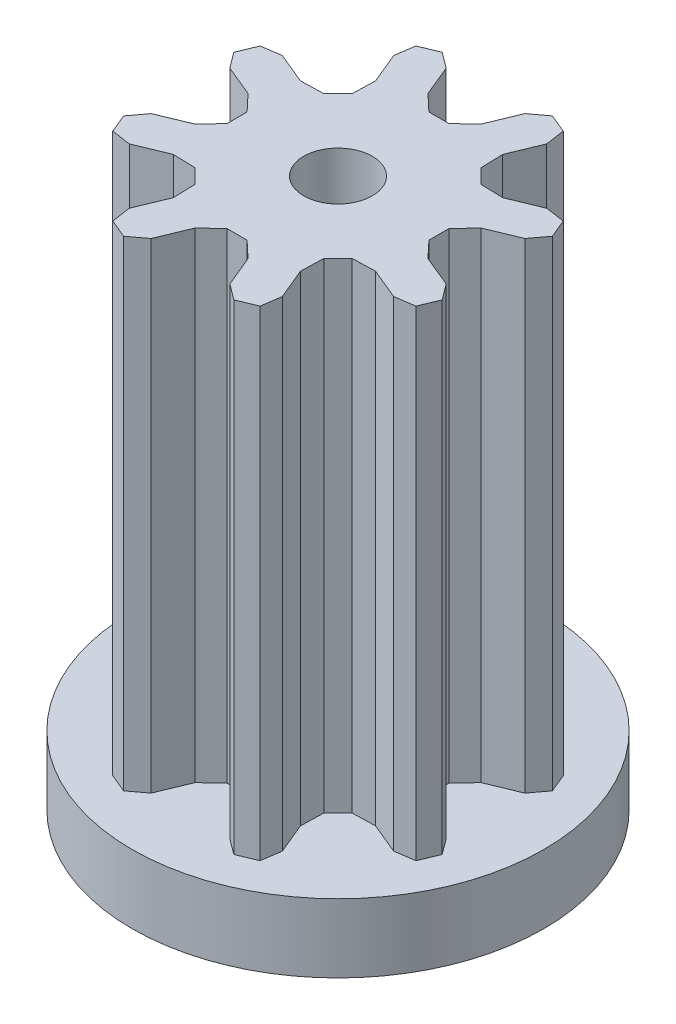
ISO-10303-21;
HEADER;
FILE_DESCRIPTION(('STEP AP214'),'2;1');
FILE_NAME('part.step','',(''),(''),'','','');
FILE_SCHEMA(('AUTOMOTIVE_DESIGN { 1 0 10303 214 1 1 1 1 }'));
ENDSEC;
DATA;
#1=APPLICATION_CONTEXT('core data for automotive mechanical design processes');
#2=APPLICATION_PROTOCOL_DEFINITION('international standard','automotive_design',2000,#1);
#3=PRODUCT_CONTEXT('',#1,'mechanical');
#4=PRODUCT('Part','Part','',(#3));
#5=PRODUCT_RELATED_PRODUCT_CATEGORY('part','',(#4));
#6=PRODUCT_DEFINITION_FORMATION('','',#4);
#7=PRODUCT_DEFINITION_CONTEXT('part definition',#1,'design');
#8=PRODUCT_DEFINITION('design','',#6,#7);
#9=PRODUCT_DEFINITION_SHAPE('','',#8);
#10=(LENGTH_UNIT() NAMED_UNIT(*) SI_UNIT(.MILLI.,.METRE.));
#11=(NAMED_UNIT(*) PLANE_ANGLE_UNIT() SI_UNIT($,.RADIAN.));
#12=(NAMED_UNIT(*) SI_UNIT($,.STERADIAN.) SOLID_ANGLE_UNIT());
#13=UNCERTAINTY_MEASURE_WITH_UNIT(LENGTH_MEASURE(1.E-05),#10,'distance_accuracy_value','');
#14=(GEOMETRIC_REPRESENTATION_CONTEXT(3) GLOBAL_UNCERTAINTY_ASSIGNED_CONTEXT((#13)) GLOBAL_UNIT_ASSIGNED_CONTEXT((#10,
#11,#12)) REPRESENTATION_CONTEXT('',''));
#15=CARTESIAN_POINT('',(0.,0.,0.));
#16=DIRECTION('',(0.,0.,1.));
#17=DIRECTION('',(1.,0.,0.));
#18=AXIS2_PLACEMENT_3D('',#15,#16,#17);
#19=CARTESIAN_POINT('',(0.5,8.,0.));
#20=DIRECTION('',(0.,1.,0.));
#21=DIRECTION('',(0.,0.,1.));
#22=AXIS2_PLACEMENT_3D('',#19,#20,#21);
#23=PLANE('',#22);
#24=CARTESIAN_POINT('',(0.,8.,0.));
#25=DIRECTION('',(0.,-1.,0.));
#26=DIRECTION('',(0.,0.,-1.));
#27=AXIS2_PLACEMENT_3D('',#24,#25,#26);
#28=CIRCLE('',#27,0.5);
#29=CARTESIAN_POINT('',(0.,8.,-0.5));
#30=VERTEX_POINT('',#29);
#31=EDGE_CURVE('E11',#30,#30,#28,.T.);
#32=ORIENTED_EDGE('',*,*,#31,.T.);
#33=EDGE_LOOP('',(#32));
#34=FACE_BOUND('',#33,.T.);
#35=DIRECTION('',(0.923879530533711,0.,0.382683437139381));
#36=VECTOR('',#35,1.);
#37=CARTESIAN_POINT('',(-1.0735056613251,8.,2.20932523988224));
#38=LINE('',#37,#36);
#39=CARTESIAN_POINT('',(-1.0735056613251,8.,2.20932523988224));
#40=VERTEX_POINT('',#39);
#41=CARTESIAN_POINT('',(-0.803145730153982,8.,2.32131199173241));
#42=VERTEX_POINT('',#41);
#43=EDGE_CURVE('E630',#40,#42,#38,.T.);
#44=ORIENTED_EDGE('',*,*,#43,.T.);
#45=DIRECTION('',(0.802047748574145,0.,-0.59725991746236));
#46=VECTOR('',#45,1.);
#47=CARTESIAN_POINT('',(-0.803145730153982,8.,2.32131199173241));
#48=LINE('',#47,#46);
#49=CARTESIAN_POINT('',(-0.574133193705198,8.,2.15077350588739));
#50=VERTEX_POINT('',#49);
#51=EDGE_CURVE('E451',#42,#50,#48,.T.);
#52=ORIENTED_EDGE('',*,*,#51,.T.);
#53=DIRECTION('',(0.382683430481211,0.,-0.923879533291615));
#54=VECTOR('',#53,1.);
#55=CARTESIAN_POINT('',(-0.574133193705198,8.,2.15077350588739));
#56=LINE('',#55,#54);
#57=CARTESIAN_POINT('',(-0.386468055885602,8.,1.69770978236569));
#58=VERTEX_POINT('',#57);
#59=EDGE_CURVE('E449',#50,#58,#56,.T.);
#60=ORIENTED_EDGE('',*,*,#59,.T.);
#61=DIRECTION('',(0.727431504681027,0.,-0.686180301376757));
#62=VECTOR('',#61,1.);
#63=CARTESIAN_POINT('',(-0.386468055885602,8.,1.69770978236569));
#64=LINE('',#63,#62);
#65=CARTESIAN_POINT('',(-0.146317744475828,8.,1.47117792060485));
#66=VERTEX_POINT('',#65);
#67=EDGE_CURVE('E44',#58,#66,#64,.T.);
#68=ORIENTED_EDGE('',*,*,#67,.T.);
#69=DIRECTION('',(1.,0.,1.044798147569E-13));
#70=VECTOR('',#69,1.);
#71=CARTESIAN_POINT('',(-0.146317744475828,8.,1.47117792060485));
#72=LINE('',#71,#70);
#73=CARTESIAN_POINT('',(0.14631774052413,8.,1.47117792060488));
#74=VERTEX_POINT('',#73);
#75=EDGE_CURVE('E438',#66,#74,#72,.T.);
#76=ORIENTED_EDGE('',*,*,#75,.T.);
#77=DIRECTION('',(0.727431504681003,0.,0.686180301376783));
#78=VECTOR('',#77,1.);
#79=CARTESIAN_POINT('',(0.14631774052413,8.,1.47117792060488));
#80=LINE('',#79,#78);
#81=CARTESIAN_POINT('',(0.386468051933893,8.,1.69770978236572));
#82=VERTEX_POINT('',#81);
#83=EDGE_CURVE('E443',#74,#82,#80,.T.);
#84=ORIENTED_EDGE('',*,*,#83,.T.);
#85=DIRECTION('',(0.382683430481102,0.,0.92387953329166));
#86=VECTOR('',#85,1.);
#87=CARTESIAN_POINT('',(0.386468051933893,8.,1.69770978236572));
#88=LINE('',#87,#86);
#89=CARTESIAN_POINT('',(0.57413318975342,8.,2.1507735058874));
#90=VERTEX_POINT('',#89);
#91=EDGE_CURVE('E456',#82,#90,#88,.T.);
#92=ORIENTED_EDGE('',*,*,#91,.T.);
#93=DIRECTION('',(0.802047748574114,0.,0.597259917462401));
#94=VECTOR('',#93,1.);
#95=CARTESIAN_POINT('',(0.57413318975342,8.,2.1507735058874));
#96=LINE('',#95,#94);
#97=CARTESIAN_POINT('',(0.803145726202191,8.,2.32131199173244));
#98=VERTEX_POINT('',#97);
#99=EDGE_CURVE('E459',#90,#98,#96,.T.);
#100=ORIENTED_EDGE('',*,*,#99,.T.);
#101=DIRECTION('',(0.923879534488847,0.,-0.382683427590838));
#102=VECTOR('',#101,1.);
#103=CARTESIAN_POINT('',(0.803145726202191,8.,2.32131199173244));
#104=LINE('',#103,#102);
#105=CARTESIAN_POINT('',(1.07350565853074,8.,2.2093252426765));
#106=VERTEX_POINT('',#105);
#107=EDGE_CURVE('E462',#98,#106,#104,.T.);
#108=ORIENTED_EDGE('',*,*,#107,.T.);
#109=DIRECTION('',(0.144806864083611,0.,-0.989459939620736));
#110=VECTOR('',#109,1.);
#111=CARTESIAN_POINT('',(1.07350565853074,8.,2.2093252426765));
#112=LINE('',#111,#110);
#113=CARTESIAN_POINT('',(1.11485305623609,8.,1.92680000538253));
#114=VERTEX_POINT('',#113);
#115=EDGE_CURVE('E465',#106,#114,#112,.T.);
#116=ORIENTED_EDGE('',*,*,#115,.T.);
#117=DIRECTION('',(-0.382683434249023,0.,-0.923879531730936));
#118=VECTOR('',#117,1.);
#119=CARTESIAN_POINT('',(1.11485305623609,8.,1.92680000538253));
#120=LINE('',#119,#118);
#121=CARTESIAN_POINT('',(0.927187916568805,8.,1.47373628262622));
#122=VERTEX_POINT('',#121);
#123=EDGE_CURVE('E468',#114,#122,#120,.T.);
#124=ORIENTED_EDGE('',*,*,#123,.T.);
#125=DIRECTION('',(0.0291690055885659,0.,-0.999574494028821));
#126=VECTOR('',#125,1.);
#127=CARTESIAN_POINT('',(0.927187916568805,8.,1.47373628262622));
#128=LINE('',#127,#126);
#129=CARTESIAN_POINT('',(0.936817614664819,8.,1.1437421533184));
#130=VERTEX_POINT('',#129);
#131=EDGE_CURVE('E471',#122,#130,#128,.T.);
#132=ORIENTED_EDGE('',*,*,#131,.T.);
#133=DIRECTION('',(0.707106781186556,0.,-0.707106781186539));
#134=VECTOR('',#133,1.);
#135=CARTESIAN_POINT('',(0.936817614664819,8.,1.1437421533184));
#136=LINE('',#135,#134);
#137=CARTESIAN_POINT('',(1.14374215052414,8.,0.936817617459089));
#138=VERTEX_POINT('',#137);
#139=EDGE_CURVE('E474',#130,#138,#136,.T.);
#140=ORIENTED_EDGE('',*,*,#139,.T.);
#141=DIRECTION('',(0.999574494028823,0.,-0.0291690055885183));
#142=VECTOR('',#141,1.);
#143=CARTESIAN_POINT('',(1.14374215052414,8.,0.936817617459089));
#144=LINE('',#143,#142);
#145=CARTESIAN_POINT('',(1.47373627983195,8.,0.927187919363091));
#146=VERTEX_POINT('',#145);
#147=EDGE_CURVE('E477',#138,#146,#144,.T.);
#148=ORIENTED_EDGE('',*,*,#147,.T.);
#149=DIRECTION('',(0.923879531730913,0.,0.382683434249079));
#150=VECTOR('',#149,1.);
#151=CARTESIAN_POINT('',(1.47373627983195,8.,0.927187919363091));
#152=LINE('',#151,#150);
#153=CARTESIAN_POINT('',(1.92680000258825,8.,1.11485305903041));
#154=VERTEX_POINT('',#153);
#155=EDGE_CURVE('E480',#146,#154,#152,.T.);
#156=ORIENTED_EDGE('',*,*,#155,.T.);
#157=DIRECTION('',(0.989459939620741,0.,-0.14480686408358));
#158=VECTOR('',#157,1.);
#159=CARTESIAN_POINT('',(1.92680000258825,8.,1.11485305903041));
#160=LINE('',#159,#158);
#161=CARTESIAN_POINT('',(2.20932523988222,8.,1.07350566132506));
#162=VERTEX_POINT('',#161);
#163=EDGE_CURVE('E483',#154,#162,#160,.T.);
#164=ORIENTED_EDGE('',*,*,#163,.T.);
#165=DIRECTION('',(0.382683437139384,0.,-0.923879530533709));
#166=VECTOR('',#165,1.);
#167=CARTESIAN_POINT('',(2.20932523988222,8.,1.07350566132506));
#168=LINE('',#167,#166);
#169=CARTESIAN_POINT('',(2.32131199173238,8.,0.803145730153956));
#170=VERTEX_POINT('',#169);
#171=EDGE_CURVE('E486',#162,#170,#168,.T.);
#172=ORIENTED_EDGE('',*,*,#171,.T.);
#173=DIRECTION('',(-0.59725991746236,0.,-0.802047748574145));
#174=VECTOR('',#173,1.);
#175=CARTESIAN_POINT('',(2.32131199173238,8.,0.803145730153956));
#176=LINE('',#175,#174);
#177=CARTESIAN_POINT('',(2.15077350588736,8.,0.574133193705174));
#178=VERTEX_POINT('',#177);
#179=EDGE_CURVE('E489',#170,#178,#176,.T.);
#180=ORIENTED_EDGE('',*,*,#179,.T.);
#181=DIRECTION('',(-0.923879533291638,0.,-0.382683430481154));
#182=VECTOR('',#181,1.);
#183=CARTESIAN_POINT('',(2.15077350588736,8.,0.574133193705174));
#184=LINE('',#183,#182);
#185=CARTESIAN_POINT('',(1.69770978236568,8.,0.38646805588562));
#186=VERTEX_POINT('',#185);
#187=EDGE_CURVE('E492',#178,#186,#184,.T.);
#188=ORIENTED_EDGE('',*,*,#187,.T.);
#189=DIRECTION('',(-0.68618030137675,0.,-0.727431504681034));
#190=VECTOR('',#189,1.);
#191=CARTESIAN_POINT('',(1.69770978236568,8.,0.38646805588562));
#192=LINE('',#191,#190);
#193=CARTESIAN_POINT('',(1.47117792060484,8.,0.146317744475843));
#194=VERTEX_POINT('',#193);
#195=EDGE_CURVE('E495',#186,#194,#192,.T.);
#196=ORIENTED_EDGE('',*,*,#195,.T.);
#197=DIRECTION('',(0.,0.,-1.));
#198=VECTOR('',#197,1.);
#199=CARTESIAN_POINT('',(1.47117792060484,8.,0.146317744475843));
#200=LINE('',#199,#198);
#201=CARTESIAN_POINT('',(1.47117792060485,8.,-0.146317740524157));
#202=VERTEX_POINT('',#201);
#203=EDGE_CURVE('E498',#194,#202,#200,.T.);
#204=ORIENTED_EDGE('',*,*,#203,.T.);
#205=DIRECTION('',(0.686180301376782,0.,-0.727431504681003));
#206=VECTOR('',#205,1.);
#207=CARTESIAN_POINT('',(1.47117792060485,8.,-0.146317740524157));
#208=LINE('',#207,#206);
#209=CARTESIAN_POINT('',(1.69770978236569,8.,-0.38646805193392));
#210=VERTEX_POINT('',#209);
#211=EDGE_CURVE('E501',#202,#210,#208,.T.);
#212=ORIENTED_EDGE('',*,*,#211,.T.);
#213=DIRECTION('',(0.92387953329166,0.,-0.382683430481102));
#214=VECTOR('',#213,1.);
#215=CARTESIAN_POINT('',(1.69770978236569,8.,-0.38646805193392));
#216=LINE('',#215,#214);
#217=CARTESIAN_POINT('',(2.15077350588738,8.,-0.574133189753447));
#218=VERTEX_POINT('',#217);
#219=EDGE_CURVE('E504',#210,#218,#216,.T.);
#220=ORIENTED_EDGE('',*,*,#219,.T.);
#221=DIRECTION('',(0.597259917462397,0.,-0.802047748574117));
#222=VECTOR('',#221,1.);
#223=CARTESIAN_POINT('',(2.15077350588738,8.,-0.574133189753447));
#224=LINE('',#223,#222);
#225=CARTESIAN_POINT('',(2.32131199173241,8.,-0.803145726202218));
#226=VERTEX_POINT('',#225);
#227=EDGE_CURVE('E507',#218,#226,#224,.T.);
#228=ORIENTED_EDGE('',*,*,#227,.T.);
#229=DIRECTION('',(-0.382683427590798,0.,-0.923879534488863));
#230=VECTOR('',#229,1.);
#231=CARTESIAN_POINT('',(2.32131199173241,8.,-0.803145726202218));
#232=LINE('',#231,#230);
#233=CARTESIAN_POINT('',(2.2093252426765,8.,-1.07350565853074));
#234=VERTEX_POINT('',#233);
#235=EDGE_CURVE('E510',#226,#234,#232,.T.);
#236=ORIENTED_EDGE('',*,*,#235,.T.);
#237=DIRECTION('',(-0.989459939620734,0.,-0.144806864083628));
#238=VECTOR('',#237,1.);
#239=CARTESIAN_POINT('',(2.2093252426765,8.,-1.07350565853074));
#240=LINE('',#239,#238);
#241=CARTESIAN_POINT('',(1.92680000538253,8.,-1.1148530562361));
#242=VERTEX_POINT('',#241);
#243=EDGE_CURVE('E513',#234,#242,#240,.T.);
#244=ORIENTED_EDGE('',*,*,#243,.T.);
#245=DIRECTION('',(-0.923879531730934,0.,0.382683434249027));
#246=VECTOR('',#245,1.);
#247=CARTESIAN_POINT('',(1.92680000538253,8.,-1.1148530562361));
#248=LINE('',#247,#246);
#249=CARTESIAN_POINT('',(1.47373628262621,8.,-0.92718791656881));
#250=VERTEX_POINT('',#249);
#251=EDGE_CURVE('E516',#242,#250,#248,.T.);
#252=ORIENTED_EDGE('',*,*,#251,.T.);
#253=DIRECTION('',(-0.999574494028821,0.,-0.0291690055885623));
#254=VECTOR('',#253,1.);
#255=CARTESIAN_POINT('',(1.47373628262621,8.,-0.92718791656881));
#256=LINE('',#255,#254);
#257=CARTESIAN_POINT('',(1.1437421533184,8.,-0.936817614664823));
#258=VERTEX_POINT('',#257);
#259=EDGE_CURVE('E519',#250,#258,#256,.T.);
#260=ORIENTED_EDGE('',*,*,#259,.T.);
#261=DIRECTION('',(-0.707106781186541,0.,-0.707106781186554));
#262=VECTOR('',#261,1.);
#263=CARTESIAN_POINT('',(1.1437421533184,8.,-0.936817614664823));
#264=LINE('',#263,#262);
#265=CARTESIAN_POINT('',(0.936817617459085,8.,-1.14374215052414));
#266=VERTEX_POINT('',#265);
#267=EDGE_CURVE('E522',#258,#266,#264,.T.);
#268=ORIENTED_EDGE('',*,*,#267,.T.);
#269=DIRECTION('',(-0.029169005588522,0.,-0.999574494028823));
#270=VECTOR('',#269,1.);
#271=CARTESIAN_POINT('',(0.936817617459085,8.,-1.14374215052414));
#272=LINE('',#271,#270);
#273=CARTESIAN_POINT('',(0.927187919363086,8.,-1.47373627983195));
#274=VERTEX_POINT('',#273);
#275=EDGE_CURVE('E525',#266,#274,#272,.T.);
#276=ORIENTED_EDGE('',*,*,#275,.T.);
#277=DIRECTION('',(0.382683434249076,0.,-0.923879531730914));
#278=VECTOR('',#277,1.);
#279=CARTESIAN_POINT('',(0.927187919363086,8.,-1.47373627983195));
#280=LINE('',#279,#278);
#281=CARTESIAN_POINT('',(1.1148530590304,8.,-1.92680000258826));
#282=VERTEX_POINT('',#281);
#283=EDGE_CURVE('E528',#274,#282,#280,.T.);
#284=ORIENTED_EDGE('',*,*,#283,.T.);
#285=DIRECTION('',(-0.144806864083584,0.,-0.98945993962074));
#286=VECTOR('',#285,1.);
#287=CARTESIAN_POINT('',(1.1148530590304,8.,-1.92680000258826));
#288=LINE('',#287,#286);
#289=CARTESIAN_POINT('',(1.07350566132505,8.,-2.20932523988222));
#290=VERTEX_POINT('',#289);
#291=EDGE_CURVE('E531',#282,#290,#288,.T.);
#292=ORIENTED_EDGE('',*,*,#291,.T.);
#293=DIRECTION('',(-0.923879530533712,0.,-0.382683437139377));
#294=VECTOR('',#293,1.);
#295=CARTESIAN_POINT('',(1.07350566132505,8.,-2.20932523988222));
#296=LINE('',#295,#294);
#297=CARTESIAN_POINT('',(0.803145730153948,8.,-2.32131199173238));
#298=VERTEX_POINT('',#297);
#299=EDGE_CURVE('E534',#290,#298,#296,.T.);
#300=ORIENTED_EDGE('',*,*,#299,.T.);
#301=DIRECTION('',(-0.802047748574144,0.,0.597259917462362));
#302=VECTOR('',#301,1.);
#303=CARTESIAN_POINT('',(0.803145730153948,8.,-2.32131199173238));
#304=LINE('',#303,#302);
#305=CARTESIAN_POINT('',(0.574133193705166,8.,-2.15077350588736));
#306=VERTEX_POINT('',#305);
#307=EDGE_CURVE('E537',#298,#306,#304,.T.);
#308=ORIENTED_EDGE('',*,*,#307,.T.);
#309=DIRECTION('',(-0.382683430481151,0.,0.92387953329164));
#310=VECTOR('',#309,1.);
#311=CARTESIAN_POINT('',(0.574133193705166,8.,-2.15077350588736));
#312=LINE('',#311,#310);
#313=CARTESIAN_POINT('',(0.386468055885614,8.,-1.69770978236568));
#314=VERTEX_POINT('',#313);
#315=EDGE_CURVE('E540',#306,#314,#312,.T.);
#316=ORIENTED_EDGE('',*,*,#315,.T.);
#317=DIRECTION('',(-0.727431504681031,0.,0.686180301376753));
#318=VECTOR('',#317,1.);
#319=CARTESIAN_POINT('',(0.386468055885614,8.,-1.69770978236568));
#320=LINE('',#319,#318);
#321=CARTESIAN_POINT('',(0.146317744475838,8.,-1.47117792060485));
#322=VERTEX_POINT('',#321);
#323=EDGE_CURVE('E543',#314,#322,#320,.T.);
#324=ORIENTED_EDGE('',*,*,#323,.T.);
#325=DIRECTION('',(-1.,0.,0.));
#326=VECTOR('',#325,1.);
#327=CARTESIAN_POINT('',(0.146317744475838,8.,-1.47117792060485));
#328=LINE('',#327,#326);
#329=CARTESIAN_POINT('',(-0.146317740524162,8.,-1.47117792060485));
#330=VERTEX_POINT('',#329);
#331=EDGE_CURVE('E546',#322,#330,#328,.T.);
#332=ORIENTED_EDGE('',*,*,#331,.T.);
#333=DIRECTION('',(-0.727431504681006,0.,-0.686180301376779));
#334=VECTOR('',#333,1.);
#335=CARTESIAN_POINT('',(-0.146317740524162,8.,-1.47117792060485));
#336=LINE('',#335,#334);
#337=CARTESIAN_POINT('',(-0.386468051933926,8.,-1.69770978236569));
#338=VERTEX_POINT('',#337);
#339=EDGE_CURVE('E549',#330,#338,#336,.T.);
#340=ORIENTED_EDGE('',*,*,#339,.T.);
#341=DIRECTION('',(-0.382683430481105,0.,-0.923879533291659));
#342=VECTOR('',#341,1.);
#343=CARTESIAN_POINT('',(-0.386468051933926,8.,-1.69770978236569));
#344=LINE('',#343,#342);
#345=CARTESIAN_POINT('',(-0.574133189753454,8.,-2.15077350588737));
#346=VERTEX_POINT('',#345);
#347=EDGE_CURVE('E552',#338,#346,#344,.T.);
#348=ORIENTED_EDGE('',*,*,#347,.T.);
#349=DIRECTION('',(-0.802047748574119,0.,-0.597259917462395));
#350=VECTOR('',#349,1.);
#351=CARTESIAN_POINT('',(-0.574133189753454,8.,-2.15077350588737));
#352=LINE('',#351,#350);
#353=CARTESIAN_POINT('',(-0.803145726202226,8.,-2.32131199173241));
#354=VERTEX_POINT('',#353);
#355=EDGE_CURVE('E555',#346,#354,#352,.T.);
#356=ORIENTED_EDGE('',*,*,#355,.T.);
#357=DIRECTION('',(-0.923879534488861,0.,0.382683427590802));
#358=VECTOR('',#357,1.);
#359=CARTESIAN_POINT('',(-0.803145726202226,8.,-2.32131199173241));
#360=LINE('',#359,#358);
#361=CARTESIAN_POINT('',(-1.07350565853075,8.,-2.2093252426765));
#362=VERTEX_POINT('',#361);
#363=EDGE_CURVE('E558',#354,#362,#360,.T.);
#364=ORIENTED_EDGE('',*,*,#363,.T.);
#365=DIRECTION('',(-0.144806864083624,0.,0.989459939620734));
#366=VECTOR('',#365,1.);
#367=CARTESIAN_POINT('',(-1.07350565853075,8.,-2.2093252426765));
#368=LINE('',#367,#366);
#369=CARTESIAN_POINT('',(-1.11485305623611,8.,-1.92680000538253));
#370=VERTEX_POINT('',#369);
#371=EDGE_CURVE('E561',#362,#370,#368,.T.);
#372=ORIENTED_EDGE('',*,*,#371,.T.);
#373=DIRECTION('',(0.38268343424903,0.,0.923879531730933));
#374=VECTOR('',#373,1.);
#375=CARTESIAN_POINT('',(-1.11485305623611,8.,-1.92680000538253));
#376=LINE('',#375,#374);
#377=CARTESIAN_POINT('',(-0.927187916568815,8.,-1.47373628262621));
#378=VERTEX_POINT('',#377);
#379=EDGE_CURVE('E564',#370,#378,#376,.T.);
#380=ORIENTED_EDGE('',*,*,#379,.T.);
#381=DIRECTION('',(-0.0291690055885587,0.,0.999574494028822));
#382=VECTOR('',#381,1.);
#383=CARTESIAN_POINT('',(-0.927187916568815,8.,-1.47373628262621));
#384=LINE('',#383,#382);
#385=CARTESIAN_POINT('',(-0.936817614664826,8.,-1.14374215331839));
#386=VERTEX_POINT('',#385);
#387=EDGE_CURVE('E567',#378,#386,#384,.T.);
#388=ORIENTED_EDGE('',*,*,#387,.T.);
#389=DIRECTION('',(-0.707106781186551,0.,0.707106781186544));
#390=VECTOR('',#389,1.);
#391=CARTESIAN_POINT('',(-0.936817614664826,8.,-1.14374215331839));
#392=LINE('',#391,#390);
#393=CARTESIAN_POINT('',(-1.14374215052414,8.,-0.936817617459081));
#394=VERTEX_POINT('',#393);
#395=EDGE_CURVE('E570',#386,#394,#392,.T.);
#396=ORIENTED_EDGE('',*,*,#395,.T.);
#397=DIRECTION('',(-0.999574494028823,0.,0.0291690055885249));
#398=VECTOR('',#397,1.);
#399=CARTESIAN_POINT('',(-1.14374215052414,8.,-0.936817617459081));
#400=LINE('',#399,#398);
#401=CARTESIAN_POINT('',(-1.47373627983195,8.,-0.927187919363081));
#402=VERTEX_POINT('',#401);
#403=EDGE_CURVE('E573',#394,#402,#400,.T.);
#404=ORIENTED_EDGE('',*,*,#403,.T.);
#405=DIRECTION('',(-0.923879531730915,0.,-0.382683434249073));
#406=VECTOR('',#405,1.);
#407=CARTESIAN_POINT('',(-1.47373627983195,8.,-0.927187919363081));
#408=LINE('',#407,#406);
#409=CARTESIAN_POINT('',(-1.92680000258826,8.,-1.11485305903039));
#410=VERTEX_POINT('',#409);
#411=EDGE_CURVE('E576',#402,#410,#408,.T.);
#412=ORIENTED_EDGE('',*,*,#411,.T.);
#413=DIRECTION('',(-0.989459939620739,0.,0.144806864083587));
#414=VECTOR('',#413,1.);
#415=CARTESIAN_POINT('',(-1.92680000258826,8.,-1.11485305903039));
#416=LINE('',#415,#414);
#417=CARTESIAN_POINT('',(-2.20932523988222,8.,-1.07350566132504));
#418=VERTEX_POINT('',#417);
#419=EDGE_CURVE('E579',#410,#418,#416,.T.);
#420=ORIENTED_EDGE('',*,*,#419,.T.);
#421=DIRECTION('',(-0.382683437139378,0.,0.923879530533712));
#422=VECTOR('',#421,1.);
#423=CARTESIAN_POINT('',(-2.20932523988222,8.,-1.07350566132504));
#424=LINE('',#423,#422);
#425=CARTESIAN_POINT('',(-2.32131199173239,8.,-0.80314573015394));
#426=VERTEX_POINT('',#425);
#427=EDGE_CURVE('E582',#418,#426,#424,.T.);
#428=ORIENTED_EDGE('',*,*,#427,.T.);
#429=DIRECTION('',(0.597259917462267,0.,0.802047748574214));
#430=VECTOR('',#429,1.);
#431=CARTESIAN_POINT('',(-2.32131199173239,8.,-0.80314573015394));
#432=LINE('',#431,#430);
#433=CARTESIAN_POINT('',(-2.15077350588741,8.,-0.574133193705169));
#434=VERTEX_POINT('',#433);
#435=EDGE_CURVE('E585',#426,#434,#432,.T.);
#436=ORIENTED_EDGE('',*,*,#435,.T.);
#437=DIRECTION('',(0.923879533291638,0.,0.382683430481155));
#438=VECTOR('',#437,1.);
#439=CARTESIAN_POINT('',(-2.15077350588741,8.,-0.574133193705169));
#440=LINE('',#439,#438);
#441=CARTESIAN_POINT('',(-1.69770978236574,8.,-0.386468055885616));
#442=VERTEX_POINT('',#441);
#443=EDGE_CURVE('E588',#434,#442,#440,.T.);
#444=ORIENTED_EDGE('',*,*,#443,.T.);
#445=DIRECTION('',(0.686180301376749,0.,0.727431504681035));
#446=VECTOR('',#445,1.);
#447=CARTESIAN_POINT('',(-1.69770978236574,8.,-0.386468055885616));
#448=LINE('',#447,#446);
#449=CARTESIAN_POINT('',(-1.4711779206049,8.,-0.14631774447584));
#450=VERTEX_POINT('',#449);
#451=EDGE_CURVE('E591',#442,#450,#448,.T.);
#452=ORIENTED_EDGE('',*,*,#451,.T.);
#453=DIRECTION('',(0.,0.,1.));
#454=VECTOR('',#453,1.);
#455=CARTESIAN_POINT('',(-1.4711779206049,8.,-0.14631774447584));
#456=LINE('',#455,#454);
#457=CARTESIAN_POINT('',(-1.4711779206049,8.,0.14631774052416));
#458=VERTEX_POINT('',#457);
#459=EDGE_CURVE('E594',#450,#458,#456,.T.);
#460=ORIENTED_EDGE('',*,*,#459,.T.);
#461=DIRECTION('',(-0.686180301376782,0.,0.727431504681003));
#462=VECTOR('',#461,1.);
#463=CARTESIAN_POINT('',(-1.4711779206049,8.,0.14631774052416));
#464=LINE('',#463,#462);
#465=CARTESIAN_POINT('',(-1.69770978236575,8.,0.386468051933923));
#466=VERTEX_POINT('',#465);
#467=EDGE_CURVE('E597',#458,#466,#464,.T.);
#468=ORIENTED_EDGE('',*,*,#467,.T.);
#469=DIRECTION('',(-0.92387953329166,0.,0.382683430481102));
#470=VECTOR('',#469,1.);
#471=CARTESIAN_POINT('',(-1.69770978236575,8.,0.386468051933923));
#472=LINE('',#471,#470);
#473=CARTESIAN_POINT('',(-2.15077350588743,8.,0.57413318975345));
#474=VERTEX_POINT('',#473);
#475=EDGE_CURVE('E600',#466,#474,#472,.T.);
#476=ORIENTED_EDGE('',*,*,#475,.T.);
#477=DIRECTION('',(-0.5972599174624,0.,0.802047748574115));
#478=VECTOR('',#477,1.);
#479=CARTESIAN_POINT('',(-2.15077350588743,8.,0.57413318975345));
#480=LINE('',#479,#478);
#481=CARTESIAN_POINT('',(-2.32131199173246,8.,0.803145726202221));
#482=VERTEX_POINT('',#481);
#483=EDGE_CURVE('E603',#474,#482,#480,.T.);
#484=ORIENTED_EDGE('',*,*,#483,.T.);
#485=DIRECTION('',(0.382683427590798,0.,0.923879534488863));
#486=VECTOR('',#485,1.);
#487=CARTESIAN_POINT('',(-2.32131199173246,8.,0.803145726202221));
#488=LINE('',#487,#486);
#489=CARTESIAN_POINT('',(-2.20932524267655,8.,1.07350565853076));
#490=VERTEX_POINT('',#489);
#491=EDGE_CURVE('E606',#482,#490,#488,.T.);
#492=ORIENTED_EDGE('',*,*,#491,.T.);
#493=DIRECTION('',(0.989459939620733,0.,0.144806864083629));
#494=VECTOR('',#493,1.);
#495=CARTESIAN_POINT('',(-2.20932524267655,8.,1.07350565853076));
#496=LINE('',#495,#494);
#497=CARTESIAN_POINT('',(-1.92680000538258,8.,1.11485305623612));
#498=VERTEX_POINT('',#497);
#499=EDGE_CURVE('E609',#490,#498,#496,.T.);
#500=ORIENTED_EDGE('',*,*,#499,.T.);
#501=DIRECTION('',(0.923879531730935,0.,-0.382683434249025));
#502=VECTOR('',#501,1.);
#503=CARTESIAN_POINT('',(-1.92680000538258,8.,1.11485305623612));
#504=LINE('',#503,#502);
#505=CARTESIAN_POINT('',(-1.47373628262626,8.,0.927187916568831));
#506=VERTEX_POINT('',#505);
#507=EDGE_CURVE('E612',#498,#506,#504,.T.);
#508=ORIENTED_EDGE('',*,*,#507,.T.);
#509=DIRECTION('',(0.999574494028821,0.,0.0291690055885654));
#510=VECTOR('',#509,1.);
#511=CARTESIAN_POINT('',(-1.47373628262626,8.,0.927187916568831));
#512=LINE('',#511,#510);
#513=CARTESIAN_POINT('',(-1.14374215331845,8.,0.936817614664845));
#514=VERTEX_POINT('',#513);
#515=EDGE_CURVE('E615',#506,#514,#512,.T.);
#516=ORIENTED_EDGE('',*,*,#515,.T.);
#517=DIRECTION('',(0.707106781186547,0.,0.707106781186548));
#518=VECTOR('',#517,1.);
#519=CARTESIAN_POINT('',(-1.14374215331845,8.,0.936817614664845));
#520=LINE('',#519,#518);
#521=CARTESIAN_POINT('',(-0.936817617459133,8.,1.14374215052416));
#522=VERTEX_POINT('',#521);
#523=EDGE_CURVE('E618',#514,#522,#520,.T.);
#524=ORIENTED_EDGE('',*,*,#523,.T.);
#525=DIRECTION('',(0.0291690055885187,0.,0.999574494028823));
#526=VECTOR('',#525,1.);
#527=CARTESIAN_POINT('',(-0.936817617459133,8.,1.14374215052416));
#528=LINE('',#527,#526);
#529=CARTESIAN_POINT('',(-0.927187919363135,8.,1.47373627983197));
#530=VERTEX_POINT('',#529);
#531=EDGE_CURVE('E621',#522,#530,#528,.T.);
#532=ORIENTED_EDGE('',*,*,#531,.T.);
#533=DIRECTION('',(-0.382683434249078,0.,0.923879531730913));
#534=VECTOR('',#533,1.);
#535=CARTESIAN_POINT('',(-0.927187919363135,8.,1.47373627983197));
#536=LINE('',#535,#534);
#537=CARTESIAN_POINT('',(-1.11485305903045,8.,1.92680000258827));
#538=VERTEX_POINT('',#537);
#539=EDGE_CURVE('E624',#530,#538,#536,.T.);
#540=ORIENTED_EDGE('',*,*,#539,.T.);
#541=DIRECTION('',(0.14480686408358,0.,0.989459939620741));
#542=VECTOR('',#541,1.);
#543=CARTESIAN_POINT('',(-1.11485305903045,8.,1.92680000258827));
#544=LINE('',#543,#542);
#545=EDGE_CURVE('E627',#538,#40,#544,.T.);
#546=ORIENTED_EDGE('',*,*,#545,.T.);
#547=EDGE_LOOP('',(#44,#52,#60,#68,#76,#84,#92,#100,#108,#116,#124,#132,#140,#148,#156,#164,
#172,#180,#188,#196,#204,#212,#220,#228,#236,#244,#252,#260,#268,#276,#284,#292,#300,#308,#316,
#324,#332,#340,#348,#356,#364,#372,#380,#388,#396,#404,#412,#420,#428,#436,#444,#452,#460,#468,
#476,#484,#492,#500,#508,#516,#524,#532,#540,#546));
#548=FACE_BOUND('',#547,.T.);
#549=ADVANCED_FACE('F29',(#34,#548),#23,.T.);
#550=CARTESIAN_POINT('',(0.,-3.16857730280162,0.));
#551=DIRECTION('',(0.,-1.,0.));
#552=DIRECTION('',(0.,0.,-1.));
#553=AXIS2_PLACEMENT_3D('',#550,#551,#552);
#554=CYLINDRICAL_SURFACE('',#553,3.);
#555=CARTESIAN_POINT('',(0.,0.,0.));
#556=DIRECTION('',(0.,-1.,0.));
#557=DIRECTION('',(0.,0.,-1.));
#558=AXIS2_PLACEMENT_3D('',#555,#556,#557);
#559=CIRCLE('',#558,3.);
#560=CARTESIAN_POINT('',(0.,0.,-3.));
#561=VERTEX_POINT('',#560);
#562=EDGE_CURVE('E37',#561,#561,#559,.T.);
#563=ORIENTED_EDGE('',*,*,#562,.F.);
#564=EDGE_LOOP('',(#563));
#565=FACE_BOUND('',#564,.T.);
#566=CARTESIAN_POINT('',(0.,1.,0.));
#567=DIRECTION('',(0.,1.,0.));
#568=DIRECTION('',(0.,0.,1.));
#569=AXIS2_PLACEMENT_3D('',#566,#567,#568);
#570=CIRCLE('',#569,3.);
#571=CARTESIAN_POINT('',(0.,1.,3.));
#572=VERTEX_POINT('',#571);
#573=EDGE_CURVE('E824',#572,#572,#570,.T.);
#574=ORIENTED_EDGE('',*,*,#573,.F.);
#575=EDGE_LOOP('',(#574));
#576=FACE_BOUND('',#575,.T.);
#577=ADVANCED_FACE('F956',(#565,#576),#554,.T.);
#578=CARTESIAN_POINT('',(0.,-3.16857730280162,0.));
#579=DIRECTION('',(0.,-1.,0.));
#580=DIRECTION('',(0.,0.,-1.));
#581=AXIS2_PLACEMENT_3D('',#578,#579,#580);
#582=CYLINDRICAL_SURFACE('',#581,0.5);
#583=CARTESIAN_POINT('',(0.,0.,0.));
#584=DIRECTION('',(0.,-1.,0.));
#585=DIRECTION('',(0.,0.,-1.));
#586=AXIS2_PLACEMENT_3D('',#583,#584,#585);
#587=CIRCLE('',#586,0.5);
#588=CARTESIAN_POINT('',(0.,0.,-0.5));
#589=VERTEX_POINT('',#588);
#590=EDGE_CURVE('E948',#589,#589,#587,.T.);
#591=ORIENTED_EDGE('',*,*,#590,.T.);
#592=EDGE_LOOP('',(#591));
#593=FACE_BOUND('',#592,.T.);
#594=ORIENTED_EDGE('',*,*,#31,.F.);
#595=EDGE_LOOP('',(#594));
#596=FACE_BOUND('',#595,.T.);
#597=ADVANCED_FACE('F31',(#593,#596),#582,.F.);
#598=CARTESIAN_POINT('',(0.5,0.,0.));
#599=DIRECTION('',(0.,-1.,0.));
#600=DIRECTION('',(0.,0.,-1.));
#601=AXIS2_PLACEMENT_3D('',#598,#599,#600);
#602=PLANE('',#601);
#603=ORIENTED_EDGE('',*,*,#562,.T.);
#604=EDGE_LOOP('',(#603));
#605=FACE_BOUND('',#604,.T.);
#606=ORIENTED_EDGE('',*,*,#590,.F.);
#607=EDGE_LOOP('',(#606));
#608=FACE_BOUND('',#607,.T.);
#609=ADVANCED_FACE('F953',(#605,#608),#602,.T.);
#610=CARTESIAN_POINT('',(0.,1.,0.));
#611=DIRECTION('',(0.,1.,0.));
#612=DIRECTION('',(0.,0.,1.));
#613=AXIS2_PLACEMENT_3D('',#610,#611,#612);
#614=PLANE('',#613);
#615=DIRECTION('',(0.923879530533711,0.,0.382683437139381));
#616=VECTOR('',#615,1.);
#617=CARTESIAN_POINT('',(-1.0735056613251,1.,2.20932523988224));
#618=LINE('',#617,#616);
#619=CARTESIAN_POINT('',(-1.0735056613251,1.,2.20932523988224));
#620=VERTEX_POINT('',#619);
#621=CARTESIAN_POINT('',(-0.803145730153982,1.,2.32131199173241));
#622=VERTEX_POINT('',#621);
#623=EDGE_CURVE('E818',#620,#622,#618,.T.);
#624=ORIENTED_EDGE('',*,*,#623,.F.);
#625=DIRECTION('',(0.14480686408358,0.,0.989459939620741));
#626=VECTOR('',#625,1.);
#627=CARTESIAN_POINT('',(-1.11485305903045,1.,1.92680000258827));
#628=LINE('',#627,#626);
#629=CARTESIAN_POINT('',(-1.11485305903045,1.,1.92680000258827));
#630=VERTEX_POINT('',#629);
#631=EDGE_CURVE('E815',#630,#620,#628,.T.);
#632=ORIENTED_EDGE('',*,*,#631,.F.);
#633=DIRECTION('',(-0.382683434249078,0.,0.923879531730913));
#634=VECTOR('',#633,1.);
#635=CARTESIAN_POINT('',(-0.927187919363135,1.,1.47373627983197));
#636=LINE('',#635,#634);
#637=CARTESIAN_POINT('',(-0.927187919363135,1.,1.47373627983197));
#638=VERTEX_POINT('',#637);
#639=EDGE_CURVE('E812',#638,#630,#636,.T.);
#640=ORIENTED_EDGE('',*,*,#639,.F.);
#641=DIRECTION('',(0.0291690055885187,0.,0.999574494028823));
#642=VECTOR('',#641,1.);
#643=CARTESIAN_POINT('',(-0.936817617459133,1.,1.14374215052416));
#644=LINE('',#643,#642);
#645=CARTESIAN_POINT('',(-0.936817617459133,1.,1.14374215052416));
#646=VERTEX_POINT('',#645);
#647=EDGE_CURVE('E809',#646,#638,#644,.T.);
#648=ORIENTED_EDGE('',*,*,#647,.F.);
#649=DIRECTION('',(0.707106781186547,0.,0.707106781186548));
#650=VECTOR('',#649,1.);
#651=CARTESIAN_POINT('',(-1.14374215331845,1.,0.936817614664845));
#652=LINE('',#651,#650);
#653=CARTESIAN_POINT('',(-1.14374215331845,1.,0.936817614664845));
#654=VERTEX_POINT('',#653);
#655=EDGE_CURVE('E806',#654,#646,#652,.T.);
#656=ORIENTED_EDGE('',*,*,#655,.F.);
#657=DIRECTION('',(0.999574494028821,0.,0.0291690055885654));
#658=VECTOR('',#657,1.);
#659=CARTESIAN_POINT('',(-1.47373628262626,1.,0.927187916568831));
#660=LINE('',#659,#658);
#661=CARTESIAN_POINT('',(-1.47373628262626,1.,0.927187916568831));
#662=VERTEX_POINT('',#661);
#663=EDGE_CURVE('E803',#662,#654,#660,.T.);
#664=ORIENTED_EDGE('',*,*,#663,.F.);
#665=DIRECTION('',(0.923879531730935,0.,-0.382683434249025));
#666=VECTOR('',#665,1.);
#667=CARTESIAN_POINT('',(-1.92680000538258,1.,1.11485305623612));
#668=LINE('',#667,#666);
#669=CARTESIAN_POINT('',(-1.92680000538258,1.,1.11485305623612));
#670=VERTEX_POINT('',#669);
#671=EDGE_CURVE('E800',#670,#662,#668,.T.);
#672=ORIENTED_EDGE('',*,*,#671,.F.);
#673=DIRECTION('',(0.989459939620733,0.,0.144806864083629));
#674=VECTOR('',#673,1.);
#675=CARTESIAN_POINT('',(-2.20932524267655,1.,1.07350565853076));
#676=LINE('',#675,#674);
#677=CARTESIAN_POINT('',(-2.20932524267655,1.,1.07350565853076));
#678=VERTEX_POINT('',#677);
#679=EDGE_CURVE('E797',#678,#670,#676,.T.);
#680=ORIENTED_EDGE('',*,*,#679,.F.);
#681=DIRECTION('',(0.382683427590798,0.,0.923879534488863));
#682=VECTOR('',#681,1.);
#683=CARTESIAN_POINT('',(-2.32131199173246,1.,0.803145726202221));
#684=LINE('',#683,#682);
#685=CARTESIAN_POINT('',(-2.32131199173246,1.,0.803145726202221));
#686=VERTEX_POINT('',#685);
#687=EDGE_CURVE('E794',#686,#678,#684,.T.);
#688=ORIENTED_EDGE('',*,*,#687,.F.);
#689=DIRECTION('',(-0.5972599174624,0.,0.802047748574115));
#690=VECTOR('',#689,1.);
#691=CARTESIAN_POINT('',(-2.15077350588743,1.,0.57413318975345));
#692=LINE('',#691,#690);
#693=CARTESIAN_POINT('',(-2.15077350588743,1.,0.57413318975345));
#694=VERTEX_POINT('',#693);
#695=EDGE_CURVE('E791',#694,#686,#692,.T.);
#696=ORIENTED_EDGE('',*,*,#695,.F.);
#697=DIRECTION('',(-0.92387953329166,0.,0.382683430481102));
#698=VECTOR('',#697,1.);
#699=CARTESIAN_POINT('',(-1.69770978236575,1.,0.386468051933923));
#700=LINE('',#699,#698);
#701=CARTESIAN_POINT('',(-1.69770978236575,1.,0.386468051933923));
#702=VERTEX_POINT('',#701);
#703=EDGE_CURVE('E788',#702,#694,#700,.T.);
#704=ORIENTED_EDGE('',*,*,#703,.F.);
#705=DIRECTION('',(-0.686180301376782,0.,0.727431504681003));
#706=VECTOR('',#705,1.);
#707=CARTESIAN_POINT('',(-1.4711779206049,1.,0.14631774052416));
#708=LINE('',#707,#706);
#709=CARTESIAN_POINT('',(-1.4711779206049,1.,0.14631774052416));
#710=VERTEX_POINT('',#709);
#711=EDGE_CURVE('E785',#710,#702,#708,.T.);
#712=ORIENTED_EDGE('',*,*,#711,.F.);
#713=DIRECTION('',(0.,0.,1.));
#714=VECTOR('',#713,1.);
#715=CARTESIAN_POINT('',(-1.4711779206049,1.,-0.14631774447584));
#716=LINE('',#715,#714);
#717=CARTESIAN_POINT('',(-1.4711779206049,1.,-0.14631774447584));
#718=VERTEX_POINT('',#717);
#719=EDGE_CURVE('E782',#718,#710,#716,.T.);
#720=ORIENTED_EDGE('',*,*,#719,.F.);
#721=DIRECTION('',(0.686180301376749,0.,0.727431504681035));
#722=VECTOR('',#721,1.);
#723=CARTESIAN_POINT('',(-1.69770978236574,1.,-0.386468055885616));
#724=LINE('',#723,#722);
#725=CARTESIAN_POINT('',(-1.69770978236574,1.,-0.386468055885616));
#726=VERTEX_POINT('',#725);
#727=EDGE_CURVE('E779',#726,#718,#724,.T.);
#728=ORIENTED_EDGE('',*,*,#727,.F.);
#729=DIRECTION('',(0.923879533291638,0.,0.382683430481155));
#730=VECTOR('',#729,1.);
#731=CARTESIAN_POINT('',(-2.15077350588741,1.,-0.574133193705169));
#732=LINE('',#731,#730);
#733=CARTESIAN_POINT('',(-2.15077350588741,1.,-0.574133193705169));
#734=VERTEX_POINT('',#733);
#735=EDGE_CURVE('E776',#734,#726,#732,.T.);
#736=ORIENTED_EDGE('',*,*,#735,.F.);
#737=DIRECTION('',(0.597259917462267,0.,0.802047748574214));
#738=VECTOR('',#737,1.);
#739=CARTESIAN_POINT('',(-2.32131199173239,1.,-0.80314573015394));
#740=LINE('',#739,#738);
#741=CARTESIAN_POINT('',(-2.32131199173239,1.,-0.80314573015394));
#742=VERTEX_POINT('',#741);
#743=EDGE_CURVE('E773',#742,#734,#740,.T.);
#744=ORIENTED_EDGE('',*,*,#743,.F.);
#745=DIRECTION('',(-0.382683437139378,0.,0.923879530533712));
#746=VECTOR('',#745,1.);
#747=CARTESIAN_POINT('',(-2.20932523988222,1.,-1.07350566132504));
#748=LINE('',#747,#746);
#749=CARTESIAN_POINT('',(-2.20932523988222,1.,-1.07350566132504));
#750=VERTEX_POINT('',#749);
#751=EDGE_CURVE('E770',#750,#742,#748,.T.);
#752=ORIENTED_EDGE('',*,*,#751,.F.);
#753=DIRECTION('',(-0.989459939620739,0.,0.144806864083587));
#754=VECTOR('',#753,1.);
#755=CARTESIAN_POINT('',(-1.92680000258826,1.,-1.11485305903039));
#756=LINE('',#755,#754);
#757=CARTESIAN_POINT('',(-1.92680000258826,1.,-1.11485305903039));
#758=VERTEX_POINT('',#757);
#759=EDGE_CURVE('E767',#758,#750,#756,.T.);
#760=ORIENTED_EDGE('',*,*,#759,.F.);
#761=DIRECTION('',(-0.923879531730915,0.,-0.382683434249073));
#762=VECTOR('',#761,1.);
#763=CARTESIAN_POINT('',(-1.47373627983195,1.,-0.927187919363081));
#764=LINE('',#763,#762);
#765=CARTESIAN_POINT('',(-1.47373627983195,1.,-0.927187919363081));
#766=VERTEX_POINT('',#765);
#767=EDGE_CURVE('E764',#766,#758,#764,.T.);
#768=ORIENTED_EDGE('',*,*,#767,.F.);
#769=DIRECTION('',(-0.999574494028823,0.,0.0291690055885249));
#770=VECTOR('',#769,1.);
#771=CARTESIAN_POINT('',(-1.14374215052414,1.,-0.936817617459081));
#772=LINE('',#771,#770);
#773=CARTESIAN_POINT('',(-1.14374215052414,1.,-0.936817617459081));
#774=VERTEX_POINT('',#773);
#775=EDGE_CURVE('E761',#774,#766,#772,.T.);
#776=ORIENTED_EDGE('',*,*,#775,.F.);
#777=DIRECTION('',(-0.707106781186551,0.,0.707106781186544));
#778=VECTOR('',#777,1.);
#779=CARTESIAN_POINT('',(-0.936817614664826,1.,-1.14374215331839));
#780=LINE('',#779,#778);
#781=CARTESIAN_POINT('',(-0.936817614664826,1.,-1.14374215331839));
#782=VERTEX_POINT('',#781);
#783=EDGE_CURVE('E758',#782,#774,#780,.T.);
#784=ORIENTED_EDGE('',*,*,#783,.F.);
#785=DIRECTION('',(-0.0291690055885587,0.,0.999574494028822));
#786=VECTOR('',#785,1.);
#787=CARTESIAN_POINT('',(-0.927187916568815,1.,-1.47373628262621));
#788=LINE('',#787,#786);
#789=CARTESIAN_POINT('',(-0.927187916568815,1.,-1.47373628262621));
#790=VERTEX_POINT('',#789);
#791=EDGE_CURVE('E755',#790,#782,#788,.T.);
#792=ORIENTED_EDGE('',*,*,#791,.F.);
#793=DIRECTION('',(0.38268343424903,0.,0.923879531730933));
#794=VECTOR('',#793,1.);
#795=CARTESIAN_POINT('',(-1.11485305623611,1.,-1.92680000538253));
#796=LINE('',#795,#794);
#797=CARTESIAN_POINT('',(-1.11485305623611,1.,-1.92680000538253));
#798=VERTEX_POINT('',#797);
#799=EDGE_CURVE('E752',#798,#790,#796,.T.);
#800=ORIENTED_EDGE('',*,*,#799,.F.);
#801=DIRECTION('',(-0.144806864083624,0.,0.989459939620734));
#802=VECTOR('',#801,1.);
#803=CARTESIAN_POINT('',(-1.07350565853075,1.,-2.2093252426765));
#804=LINE('',#803,#802);
#805=CARTESIAN_POINT('',(-1.07350565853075,1.,-2.2093252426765));
#806=VERTEX_POINT('',#805);
#807=EDGE_CURVE('E749',#806,#798,#804,.T.);
#808=ORIENTED_EDGE('',*,*,#807,.F.);
#809=DIRECTION('',(-0.923879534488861,0.,0.382683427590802));
#810=VECTOR('',#809,1.);
#811=CARTESIAN_POINT('',(-0.803145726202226,1.,-2.32131199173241));
#812=LINE('',#811,#810);
#813=CARTESIAN_POINT('',(-0.803145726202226,1.,-2.32131199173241));
#814=VERTEX_POINT('',#813);
#815=EDGE_CURVE('E746',#814,#806,#812,.T.);
#816=ORIENTED_EDGE('',*,*,#815,.F.);
#817=DIRECTION('',(-0.802047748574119,0.,-0.597259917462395));
#818=VECTOR('',#817,1.);
#819=CARTESIAN_POINT('',(-0.574133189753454,1.,-2.15077350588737));
#820=LINE('',#819,#818);
#821=CARTESIAN_POINT('',(-0.574133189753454,1.,-2.15077350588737));
#822=VERTEX_POINT('',#821);
#823=EDGE_CURVE('E743',#822,#814,#820,.T.);
#824=ORIENTED_EDGE('',*,*,#823,.F.);
#825=DIRECTION('',(-0.382683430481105,0.,-0.923879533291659));
#826=VECTOR('',#825,1.);
#827=CARTESIAN_POINT('',(-0.386468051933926,1.,-1.69770978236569));
#828=LINE('',#827,#826);
#829=CARTESIAN_POINT('',(-0.386468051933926,1.,-1.69770978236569));
#830=VERTEX_POINT('',#829);
#831=EDGE_CURVE('E740',#830,#822,#828,.T.);
#832=ORIENTED_EDGE('',*,*,#831,.F.);
#833=DIRECTION('',(-0.727431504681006,0.,-0.686180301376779));
#834=VECTOR('',#833,1.);
#835=CARTESIAN_POINT('',(-0.146317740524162,1.,-1.47117792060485));
#836=LINE('',#835,#834);
#837=CARTESIAN_POINT('',(-0.146317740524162,1.,-1.47117792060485));
#838=VERTEX_POINT('',#837);
#839=EDGE_CURVE('E737',#838,#830,#836,.T.);
#840=ORIENTED_EDGE('',*,*,#839,.F.);
#841=DIRECTION('',(-1.,0.,0.));
#842=VECTOR('',#841,1.);
#843=CARTESIAN_POINT('',(0.146317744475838,1.,-1.47117792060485));
#844=LINE('',#843,#842);
#845=CARTESIAN_POINT('',(0.146317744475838,1.,-1.47117792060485));
#846=VERTEX_POINT('',#845);
#847=EDGE_CURVE('E734',#846,#838,#844,.T.);
#848=ORIENTED_EDGE('',*,*,#847,.F.);
#849=DIRECTION('',(-0.727431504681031,0.,0.686180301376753));
#850=VECTOR('',#849,1.);
#851=CARTESIAN_POINT('',(0.386468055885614,1.,-1.69770978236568));
#852=LINE('',#851,#850);
#853=CARTESIAN_POINT('',(0.386468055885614,1.,-1.69770978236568));
#854=VERTEX_POINT('',#853);
#855=EDGE_CURVE('E731',#854,#846,#852,.T.);
#856=ORIENTED_EDGE('',*,*,#855,.F.);
#857=DIRECTION('',(-0.382683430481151,0.,0.92387953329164));
#858=VECTOR('',#857,1.);
#859=CARTESIAN_POINT('',(0.574133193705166,1.,-2.15077350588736));
#860=LINE('',#859,#858);
#861=CARTESIAN_POINT('',(0.574133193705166,1.,-2.15077350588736));
#862=VERTEX_POINT('',#861);
#863=EDGE_CURVE('E728',#862,#854,#860,.T.);
#864=ORIENTED_EDGE('',*,*,#863,.F.);
#865=DIRECTION('',(-0.802047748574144,0.,0.597259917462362));
#866=VECTOR('',#865,1.);
#867=CARTESIAN_POINT('',(0.803145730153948,1.,-2.32131199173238));
#868=LINE('',#867,#866);
#869=CARTESIAN_POINT('',(0.803145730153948,1.,-2.32131199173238));
#870=VERTEX_POINT('',#869);
#871=EDGE_CURVE('E725',#870,#862,#868,.T.);
#872=ORIENTED_EDGE('',*,*,#871,.F.);
#873=DIRECTION('',(-0.923879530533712,0.,-0.382683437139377));
#874=VECTOR('',#873,1.);
#875=CARTESIAN_POINT('',(1.07350566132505,1.,-2.20932523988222));
#876=LINE('',#875,#874);
#877=CARTESIAN_POINT('',(1.07350566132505,1.,-2.20932523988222));
#878=VERTEX_POINT('',#877);
#879=EDGE_CURVE('E722',#878,#870,#876,.T.);
#880=ORIENTED_EDGE('',*,*,#879,.F.);
#881=DIRECTION('',(-0.144806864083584,0.,-0.98945993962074));
#882=VECTOR('',#881,1.);
#883=CARTESIAN_POINT('',(1.1148530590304,1.,-1.92680000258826));
#884=LINE('',#883,#882);
#885=CARTESIAN_POINT('',(1.1148530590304,1.,-1.92680000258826));
#886=VERTEX_POINT('',#885);
#887=EDGE_CURVE('E719',#886,#878,#884,.T.);
#888=ORIENTED_EDGE('',*,*,#887,.F.);
#889=DIRECTION('',(0.382683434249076,0.,-0.923879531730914));
#890=VECTOR('',#889,1.);
#891=CARTESIAN_POINT('',(0.927187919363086,1.,-1.47373627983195));
#892=LINE('',#891,#890);
#893=CARTESIAN_POINT('',(0.927187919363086,1.,-1.47373627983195));
#894=VERTEX_POINT('',#893);
#895=EDGE_CURVE('E716',#894,#886,#892,.T.);
#896=ORIENTED_EDGE('',*,*,#895,.F.);
#897=DIRECTION('',(-0.029169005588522,0.,-0.999574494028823));
#898=VECTOR('',#897,1.);
#899=CARTESIAN_POINT('',(0.936817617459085,1.,-1.14374215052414));
#900=LINE('',#899,#898);
#901=CARTESIAN_POINT('',(0.936817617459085,1.,-1.14374215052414));
#902=VERTEX_POINT('',#901);
#903=EDGE_CURVE('E713',#902,#894,#900,.T.);
#904=ORIENTED_EDGE('',*,*,#903,.F.);
#905=DIRECTION('',(-0.707106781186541,0.,-0.707106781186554));
#906=VECTOR('',#905,1.);
#907=CARTESIAN_POINT('',(1.1437421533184,1.,-0.936817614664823));
#908=LINE('',#907,#906);
#909=CARTESIAN_POINT('',(1.1437421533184,1.,-0.936817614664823));
#910=VERTEX_POINT('',#909);
#911=EDGE_CURVE('E710',#910,#902,#908,.T.);
#912=ORIENTED_EDGE('',*,*,#911,.F.);
#913=DIRECTION('',(-0.999574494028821,0.,-0.0291690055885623));
#914=VECTOR('',#913,1.);
#915=CARTESIAN_POINT('',(1.47373628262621,1.,-0.92718791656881));
#916=LINE('',#915,#914);
#917=CARTESIAN_POINT('',(1.47373628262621,1.,-0.92718791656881));
#918=VERTEX_POINT('',#917);
#919=EDGE_CURVE('E707',#918,#910,#916,.T.);
#920=ORIENTED_EDGE('',*,*,#919,.F.);
#921=DIRECTION('',(-0.923879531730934,0.,0.382683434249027));
#922=VECTOR('',#921,1.);
#923=CARTESIAN_POINT('',(1.92680000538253,1.,-1.1148530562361));
#924=LINE('',#923,#922);
#925=CARTESIAN_POINT('',(1.92680000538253,1.,-1.1148530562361));
#926=VERTEX_POINT('',#925);
#927=EDGE_CURVE('E704',#926,#918,#924,.T.);
#928=ORIENTED_EDGE('',*,*,#927,.F.);
#929=DIRECTION('',(-0.989459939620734,0.,-0.144806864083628));
#930=VECTOR('',#929,1.);
#931=CARTESIAN_POINT('',(2.2093252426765,1.,-1.07350565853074));
#932=LINE('',#931,#930);
#933=CARTESIAN_POINT('',(2.2093252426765,1.,-1.07350565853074));
#934=VERTEX_POINT('',#933);
#935=EDGE_CURVE('E701',#934,#926,#932,.T.);
#936=ORIENTED_EDGE('',*,*,#935,.F.);
#937=DIRECTION('',(-0.382683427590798,0.,-0.923879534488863));
#938=VECTOR('',#937,1.);
#939=CARTESIAN_POINT('',(2.32131199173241,1.,-0.803145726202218));
#940=LINE('',#939,#938);
#941=CARTESIAN_POINT('',(2.32131199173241,1.,-0.803145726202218));
#942=VERTEX_POINT('',#941);
#943=EDGE_CURVE('E698',#942,#934,#940,.T.);
#944=ORIENTED_EDGE('',*,*,#943,.F.);
#945=DIRECTION('',(0.597259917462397,0.,-0.802047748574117));
#946=VECTOR('',#945,1.);
#947=CARTESIAN_POINT('',(2.15077350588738,1.,-0.574133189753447));
#948=LINE('',#947,#946);
#949=CARTESIAN_POINT('',(2.15077350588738,1.,-0.574133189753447));
#950=VERTEX_POINT('',#949);
#951=EDGE_CURVE('E695',#950,#942,#948,.T.);
#952=ORIENTED_EDGE('',*,*,#951,.F.);
#953=DIRECTION('',(0.92387953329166,0.,-0.382683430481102));
#954=VECTOR('',#953,1.);
#955=CARTESIAN_POINT('',(1.69770978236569,1.,-0.38646805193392));
#956=LINE('',#955,#954);
#957=CARTESIAN_POINT('',(1.69770978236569,1.,-0.38646805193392));
#958=VERTEX_POINT('',#957);
#959=EDGE_CURVE('E692',#958,#950,#956,.T.);
#960=ORIENTED_EDGE('',*,*,#959,.F.);
#961=DIRECTION('',(0.686180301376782,0.,-0.727431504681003));
#962=VECTOR('',#961,1.);
#963=CARTESIAN_POINT('',(1.47117792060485,1.,-0.146317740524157));
#964=LINE('',#963,#962);
#965=CARTESIAN_POINT('',(1.47117792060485,1.,-0.146317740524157));
#966=VERTEX_POINT('',#965);
#967=EDGE_CURVE('E689',#966,#958,#964,.T.);
#968=ORIENTED_EDGE('',*,*,#967,.F.);
#969=DIRECTION('',(0.,0.,-1.));
#970=VECTOR('',#969,1.);
#971=CARTESIAN_POINT('',(1.47117792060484,1.,0.146317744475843));
#972=LINE('',#971,#970);
#973=CARTESIAN_POINT('',(1.47117792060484,1.,0.146317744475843));
#974=VERTEX_POINT('',#973);
#975=EDGE_CURVE('E686',#974,#966,#972,.T.);
#976=ORIENTED_EDGE('',*,*,#975,.F.);
#977=DIRECTION('',(-0.68618030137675,0.,-0.727431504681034));
#978=VECTOR('',#977,1.);
#979=CARTESIAN_POINT('',(1.69770978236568,1.,0.38646805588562));
#980=LINE('',#979,#978);
#981=CARTESIAN_POINT('',(1.69770978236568,1.,0.38646805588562));
#982=VERTEX_POINT('',#981);
#983=EDGE_CURVE('E683',#982,#974,#980,.T.);
#984=ORIENTED_EDGE('',*,*,#983,.F.);
#985=DIRECTION('',(-0.923879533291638,0.,-0.382683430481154));
#986=VECTOR('',#985,1.);
#987=CARTESIAN_POINT('',(2.15077350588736,1.,0.574133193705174));
#988=LINE('',#987,#986);
#989=CARTESIAN_POINT('',(2.15077350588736,1.,0.574133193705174));
#990=VERTEX_POINT('',#989);
#991=EDGE_CURVE('E680',#990,#982,#988,.T.);
#992=ORIENTED_EDGE('',*,*,#991,.F.);
#993=DIRECTION('',(-0.59725991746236,0.,-0.802047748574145));
#994=VECTOR('',#993,1.);
#995=CARTESIAN_POINT('',(2.32131199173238,1.,0.803145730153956));
#996=LINE('',#995,#994);
#997=CARTESIAN_POINT('',(2.32131199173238,1.,0.803145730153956));
#998=VERTEX_POINT('',#997);
#999=EDGE_CURVE('E677',#998,#990,#996,.T.);
#1000=ORIENTED_EDGE('',*,*,#999,.F.);
#1001=DIRECTION('',(0.382683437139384,0.,-0.923879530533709));
#1002=VECTOR('',#1001,1.);
#1003=CARTESIAN_POINT('',(2.20932523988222,1.,1.07350566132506));
#1004=LINE('',#1003,#1002);
#1005=CARTESIAN_POINT('',(2.20932523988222,1.,1.07350566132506));
#1006=VERTEX_POINT('',#1005);
#1007=EDGE_CURVE('E674',#1006,#998,#1004,.T.);
#1008=ORIENTED_EDGE('',*,*,#1007,.F.);
#1009=DIRECTION('',(0.989459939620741,0.,-0.14480686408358));
#1010=VECTOR('',#1009,1.);
#1011=CARTESIAN_POINT('',(1.92680000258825,1.,1.11485305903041));
#1012=LINE('',#1011,#1010);
#1013=CARTESIAN_POINT('',(1.92680000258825,1.,1.11485305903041));
#1014=VERTEX_POINT('',#1013);
#1015=EDGE_CURVE('E671',#1014,#1006,#1012,.T.);
#1016=ORIENTED_EDGE('',*,*,#1015,.F.);
#1017=DIRECTION('',(0.923879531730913,0.,0.382683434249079));
#1018=VECTOR('',#1017,1.);
#1019=CARTESIAN_POINT('',(1.47373627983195,1.,0.927187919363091));
#1020=LINE('',#1019,#1018);
#1021=CARTESIAN_POINT('',(1.47373627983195,1.,0.927187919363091));
#1022=VERTEX_POINT('',#1021);
#1023=EDGE_CURVE('E668',#1022,#1014,#1020,.T.);
#1024=ORIENTED_EDGE('',*,*,#1023,.F.);
#1025=DIRECTION('',(0.999574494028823,0.,-0.0291690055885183));
#1026=VECTOR('',#1025,1.);
#1027=CARTESIAN_POINT('',(1.14374215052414,1.,0.936817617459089));
#1028=LINE('',#1027,#1026);
#1029=CARTESIAN_POINT('',(1.14374215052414,1.,0.936817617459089));
#1030=VERTEX_POINT('',#1029);
#1031=EDGE_CURVE('E665',#1030,#1022,#1028,.T.);
#1032=ORIENTED_EDGE('',*,*,#1031,.F.);
#1033=DIRECTION('',(0.707106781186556,0.,-0.707106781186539));
#1034=VECTOR('',#1033,1.);
#1035=CARTESIAN_POINT('',(0.936817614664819,1.,1.1437421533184));
#1036=LINE('',#1035,#1034);
#1037=CARTESIAN_POINT('',(0.936817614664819,1.,1.1437421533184));
#1038=VERTEX_POINT('',#1037);
#1039=EDGE_CURVE('E662',#1038,#1030,#1036,.T.);
#1040=ORIENTED_EDGE('',*,*,#1039,.F.);
#1041=DIRECTION('',(0.0291690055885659,0.,-0.999574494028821));
#1042=VECTOR('',#1041,1.);
#1043=CARTESIAN_POINT('',(0.927187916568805,1.,1.47373628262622));
#1044=LINE('',#1043,#1042);
#1045=CARTESIAN_POINT('',(0.927187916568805,1.,1.47373628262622));
#1046=VERTEX_POINT('',#1045);
#1047=EDGE_CURVE('E659',#1046,#1038,#1044,.T.);
#1048=ORIENTED_EDGE('',*,*,#1047,.F.);
#1049=DIRECTION('',(-0.382683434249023,0.,-0.923879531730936));
#1050=VECTOR('',#1049,1.);
#1051=CARTESIAN_POINT('',(1.11485305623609,1.,1.92680000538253));
#1052=LINE('',#1051,#1050);
#1053=CARTESIAN_POINT('',(1.11485305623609,1.,1.92680000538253));
#1054=VERTEX_POINT('',#1053);
#1055=EDGE_CURVE('E656',#1054,#1046,#1052,.T.);
#1056=ORIENTED_EDGE('',*,*,#1055,.F.);
#1057=DIRECTION('',(0.144806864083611,0.,-0.989459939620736));
#1058=VECTOR('',#1057,1.);
#1059=CARTESIAN_POINT('',(1.07350565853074,1.,2.2093252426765));
#1060=LINE('',#1059,#1058);
#1061=CARTESIAN_POINT('',(1.07350565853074,1.,2.2093252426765));
#1062=VERTEX_POINT('',#1061);
#1063=EDGE_CURVE('E653',#1062,#1054,#1060,.T.);
#1064=ORIENTED_EDGE('',*,*,#1063,.F.);
#1065=DIRECTION('',(0.923879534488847,0.,-0.382683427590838));
#1066=VECTOR('',#1065,1.);
#1067=CARTESIAN_POINT('',(0.803145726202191,1.,2.32131199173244));
#1068=LINE('',#1067,#1066);
#1069=CARTESIAN_POINT('',(0.803145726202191,1.,2.32131199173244));
#1070=VERTEX_POINT('',#1069);
#1071=EDGE_CURVE('E650',#1070,#1062,#1068,.T.);
#1072=ORIENTED_EDGE('',*,*,#1071,.F.);
#1073=DIRECTION('',(0.802047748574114,0.,0.597259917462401));
#1074=VECTOR('',#1073,1.);
#1075=CARTESIAN_POINT('',(0.57413318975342,1.,2.1507735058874));
#1076=LINE('',#1075,#1074);
#1077=CARTESIAN_POINT('',(0.57413318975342,1.,2.1507735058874));
#1078=VERTEX_POINT('',#1077);
#1079=EDGE_CURVE('E647',#1078,#1070,#1076,.T.);
#1080=ORIENTED_EDGE('',*,*,#1079,.F.);
#1081=DIRECTION('',(0.382683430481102,0.,0.92387953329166));
#1082=VECTOR('',#1081,1.);
#1083=CARTESIAN_POINT('',(0.386468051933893,1.,1.69770978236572));
#1084=LINE('',#1083,#1082);
#1085=CARTESIAN_POINT('',(0.386468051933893,1.,1.69770978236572));
#1086=VERTEX_POINT('',#1085);
#1087=EDGE_CURVE('E644',#1086,#1078,#1084,.T.);
#1088=ORIENTED_EDGE('',*,*,#1087,.F.);
#1089=DIRECTION('',(0.727431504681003,0.,0.686180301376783));
#1090=VECTOR('',#1089,1.);
#1091=CARTESIAN_POINT('',(0.14631774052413,1.,1.47117792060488));
#1092=LINE('',#1091,#1090);
#1093=CARTESIAN_POINT('',(0.14631774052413,1.,1.47117792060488));
#1094=VERTEX_POINT('',#1093);
#1095=EDGE_CURVE('E641',#1094,#1086,#1092,.T.);
#1096=ORIENTED_EDGE('',*,*,#1095,.F.);
#1097=DIRECTION('',(1.,0.,1.044798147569E-13));
#1098=VECTOR('',#1097,1.);
#1099=CARTESIAN_POINT('',(-0.146317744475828,1.,1.47117792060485));
#1100=LINE('',#1099,#1098);
#1101=CARTESIAN_POINT('',(-0.146317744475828,1.,1.47117792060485));
#1102=VERTEX_POINT('',#1101);
#1103=EDGE_CURVE('E639',#1102,#1094,#1100,.T.);
#1104=ORIENTED_EDGE('',*,*,#1103,.F.);
#1105=DIRECTION('',(0.727431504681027,0.,-0.686180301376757));
#1106=VECTOR('',#1105,1.);
#1107=CARTESIAN_POINT('',(-0.386468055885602,1.,1.69770978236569));
#1108=LINE('',#1107,#1106);
#1109=CARTESIAN_POINT('',(-0.386468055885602,1.,1.69770978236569));
#1110=VERTEX_POINT('',#1109);
#1111=EDGE_CURVE('E52',#1110,#1102,#1108,.T.);
#1112=ORIENTED_EDGE('',*,*,#1111,.F.);
#1113=DIRECTION('',(0.382683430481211,0.,-0.923879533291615));
#1114=VECTOR('',#1113,1.);
#1115=CARTESIAN_POINT('',(-0.574133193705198,1.,2.15077350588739));
#1116=LINE('',#1115,#1114);
#1117=CARTESIAN_POINT('',(-0.574133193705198,1.,2.15077350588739));
#1118=VERTEX_POINT('',#1117);
#1119=EDGE_CURVE('E635',#1118,#1110,#1116,.T.);
#1120=ORIENTED_EDGE('',*,*,#1119,.F.);
#1121=DIRECTION('',(0.802047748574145,0.,-0.59725991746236));
#1122=VECTOR('',#1121,1.);
#1123=CARTESIAN_POINT('',(-0.803145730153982,1.,2.32131199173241));
#1124=LINE('',#1123,#1122);
#1125=EDGE_CURVE('E632',#622,#1118,#1124,.T.);
#1126=ORIENTED_EDGE('',*,*,#1125,.F.);
#1127=EDGE_LOOP('',(#624,#632,#640,#648,#656,#664,#672,#680,#688,#696,#704,#712,#720,#728,#736,
#744,#752,#760,#768,#776,#784,#792,#800,#808,#816,#824,#832,#840,#848,#856,#864,#872,#880,#888,
#896,#904,#912,#920,#928,#936,#944,#952,#960,#968,#976,#984,#992,#1000,#1008,#1016,#1024,#1032,
#1040,#1048,#1056,#1064,#1072,#1080,#1088,#1096,#1104,#1112,#1120,#1126));
#1128=FACE_BOUND('',#1127,.T.);
#1129=ORIENTED_EDGE('',*,*,#573,.T.);
#1130=EDGE_LOOP('',(#1129));
#1131=FACE_BOUND('',#1130,.T.);
#1132=ADVANCED_FACE('F962',(#1128,#1131),#614,.T.);
#1133=CARTESIAN_POINT('',(-0.803145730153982,1.,2.32131199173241));
#1134=DIRECTION('',(0.59725991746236,0.,0.802047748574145));
#1135=DIRECTION('',(0.802047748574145,0.,-0.59725991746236));
#1136=AXIS2_PLACEMENT_3D('',#1133,#1134,#1135);
#1137=PLANE('',#1136);
#1138=ORIENTED_EDGE('',*,*,#51,.F.);
#1139=DIRECTION('',(0.,1.,0.));
#1140=VECTOR('',#1139,1.);
#1141=CARTESIAN_POINT('',(-0.803145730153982,1.,2.32131199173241));
#1142=LINE('',#1141,#1140);
#1143=EDGE_CURVE('E822',#622,#42,#1142,.T.);
#1144=ORIENTED_EDGE('',*,*,#1143,.F.);
#1145=ORIENTED_EDGE('',*,*,#1125,.T.);
#1146=DIRECTION('',(0.,1.,0.));
#1147=VECTOR('',#1146,1.);
#1148=CARTESIAN_POINT('',(-0.574133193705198,1.,2.15077350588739));
#1149=LINE('',#1148,#1147);
#1150=EDGE_CURVE('E821',#1118,#50,#1149,.T.);
#1151=ORIENTED_EDGE('',*,*,#1150,.T.);
#1152=EDGE_LOOP('',(#1138,#1144,#1145,#1151));
#1153=FACE_BOUND('',#1152,.T.);
#1154=ADVANCED_FACE('F964',(#1153),#1137,.T.);
#1155=CARTESIAN_POINT('',(-1.0735056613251,1.,2.20932523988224));
#1156=DIRECTION('',(-0.382683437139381,0.,0.923879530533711));
#1157=DIRECTION('',(0.923879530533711,0.,0.382683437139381));
#1158=AXIS2_PLACEMENT_3D('',#1155,#1156,#1157);
#1159=PLANE('',#1158);
#1160=ORIENTED_EDGE('',*,*,#43,.F.);
#1161=DIRECTION('',(0.,1.,0.));
#1162=VECTOR('',#1161,1.);
#1163=CARTESIAN_POINT('',(-1.0735056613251,1.,2.20932523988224));
#1164=LINE('',#1163,#1162);
#1165=EDGE_CURVE('E825',#620,#40,#1164,.T.);
#1166=ORIENTED_EDGE('',*,*,#1165,.F.);
#1167=ORIENTED_EDGE('',*,*,#623,.T.);
#1168=ORIENTED_EDGE('',*,*,#1143,.T.);
#1169=EDGE_LOOP('',(#1160,#1166,#1167,#1168));
#1170=FACE_BOUND('',#1169,.T.);
#1171=ADVANCED_FACE('F969',(#1170),#1159,.T.);
#1172=CARTESIAN_POINT('',(-1.11485305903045,1.,1.92680000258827));
#1173=DIRECTION('',(-0.989459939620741,0.,0.14480686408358));
#1174=DIRECTION('',(0.14480686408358,0.,0.989459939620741));
#1175=AXIS2_PLACEMENT_3D('',#1172,#1173,#1174);
#1176=PLANE('',#1175);
#1177=ORIENTED_EDGE('',*,*,#545,.F.);
#1178=DIRECTION('',(0.,1.,0.));
#1179=VECTOR('',#1178,1.);
#1180=CARTESIAN_POINT('',(-1.11485305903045,1.,1.92680000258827));
#1181=LINE('',#1180,#1179);
#1182=EDGE_CURVE('E827',#630,#538,#1181,.T.);
#1183=ORIENTED_EDGE('',*,*,#1182,.F.);
#1184=ORIENTED_EDGE('',*,*,#631,.T.);
#1185=ORIENTED_EDGE('',*,*,#1165,.T.);
#1186=EDGE_LOOP('',(#1177,#1183,#1184,#1185));
#1187=FACE_BOUND('',#1186,.T.);
#1188=ADVANCED_FACE('F1009',(#1187),#1176,.T.);
#1189=CARTESIAN_POINT('',(-0.927187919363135,1.,1.47373627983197));
#1190=DIRECTION('',(-0.923879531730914,0.,-0.382683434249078));
#1191=DIRECTION('',(-0.382683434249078,0.,0.923879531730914));
#1192=AXIS2_PLACEMENT_3D('',#1189,#1190,#1191);
#1193=PLANE('',#1192);
#1194=ORIENTED_EDGE('',*,*,#539,.F.);
#1195=DIRECTION('',(0.,1.,0.));
#1196=VECTOR('',#1195,1.);
#1197=CARTESIAN_POINT('',(-0.927187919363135,1.,1.47373627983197));
#1198=LINE('',#1197,#1196);
#1199=EDGE_CURVE('E829',#638,#530,#1198,.T.);
#1200=ORIENTED_EDGE('',*,*,#1199,.F.);
#1201=ORIENTED_EDGE('',*,*,#639,.T.);
#1202=ORIENTED_EDGE('',*,*,#1182,.T.);
#1203=EDGE_LOOP('',(#1194,#1200,#1201,#1202));
#1204=FACE_BOUND('',#1203,.T.);
#1205=ADVANCED_FACE('F1017',(#1204),#1193,.T.);
#1206=CARTESIAN_POINT('',(-0.936817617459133,1.,1.14374215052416));
#1207=DIRECTION('',(-0.999574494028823,0.,0.0291690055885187));
#1208=DIRECTION('',(0.0291690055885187,0.,0.999574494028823));
#1209=AXIS2_PLACEMENT_3D('',#1206,#1207,#1208);
#1210=PLANE('',#1209);
#1211=ORIENTED_EDGE('',*,*,#531,.F.);
#1212=DIRECTION('',(0.,1.,0.));
#1213=VECTOR('',#1212,1.);
#1214=CARTESIAN_POINT('',(-0.936817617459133,1.,1.14374215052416));
#1215=LINE('',#1214,#1213);
#1216=EDGE_CURVE('E831',#646,#522,#1215,.T.);
#1217=ORIENTED_EDGE('',*,*,#1216,.F.);
#1218=ORIENTED_EDGE('',*,*,#647,.T.);
#1219=ORIENTED_EDGE('',*,*,#1199,.T.);
#1220=EDGE_LOOP('',(#1211,#1217,#1218,#1219));
#1221=FACE_BOUND('',#1220,.T.);
#1222=ADVANCED_FACE('F1025',(#1221),#1210,.T.);
#1223=CARTESIAN_POINT('',(-1.14374215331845,1.,0.936817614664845));
#1224=DIRECTION('',(-0.707106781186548,0.,0.707106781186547));
#1225=DIRECTION('',(0.707106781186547,0.,0.707106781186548));
#1226=AXIS2_PLACEMENT_3D('',#1223,#1224,#1225);
#1227=PLANE('',#1226);
#1228=ORIENTED_EDGE('',*,*,#523,.F.);
#1229=DIRECTION('',(0.,1.,0.));
#1230=VECTOR('',#1229,1.);
#1231=CARTESIAN_POINT('',(-1.14374215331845,1.,0.936817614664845));
#1232=LINE('',#1231,#1230);
#1233=EDGE_CURVE('E833',#654,#514,#1232,.T.);
#1234=ORIENTED_EDGE('',*,*,#1233,.F.);
#1235=ORIENTED_EDGE('',*,*,#655,.T.);
#1236=ORIENTED_EDGE('',*,*,#1216,.T.);
#1237=EDGE_LOOP('',(#1228,#1234,#1235,#1236));
#1238=FACE_BOUND('',#1237,.T.);
#1239=ADVANCED_FACE('F1033',(#1238),#1227,.T.);
#1240=CARTESIAN_POINT('',(-1.47373628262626,1.,0.927187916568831));
#1241=DIRECTION('',(-0.0291690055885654,0.,0.999574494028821));
#1242=DIRECTION('',(0.999574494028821,0.,0.0291690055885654));
#1243=AXIS2_PLACEMENT_3D('',#1240,#1241,#1242);
#1244=PLANE('',#1243);
#1245=ORIENTED_EDGE('',*,*,#515,.F.);
#1246=DIRECTION('',(0.,1.,0.));
#1247=VECTOR('',#1246,1.);
#1248=CARTESIAN_POINT('',(-1.47373628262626,1.,0.927187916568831));
#1249=LINE('',#1248,#1247);
#1250=EDGE_CURVE('E835',#662,#506,#1249,.T.);
#1251=ORIENTED_EDGE('',*,*,#1250,.F.);
#1252=ORIENTED_EDGE('',*,*,#663,.T.);
#1253=ORIENTED_EDGE('',*,*,#1233,.T.);
#1254=EDGE_LOOP('',(#1245,#1251,#1252,#1253));
#1255=FACE_BOUND('',#1254,.T.);
#1256=ADVANCED_FACE('F1041',(#1255),#1244,.T.);
#1257=CARTESIAN_POINT('',(-1.92680000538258,1.,1.11485305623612));
#1258=DIRECTION('',(0.382683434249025,0.,0.923879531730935));
#1259=DIRECTION('',(0.923879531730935,0.,-0.382683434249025));
#1260=AXIS2_PLACEMENT_3D('',#1257,#1258,#1259);
#1261=PLANE('',#1260);
#1262=ORIENTED_EDGE('',*,*,#507,.F.);
#1263=DIRECTION('',(0.,1.,0.));
#1264=VECTOR('',#1263,1.);
#1265=CARTESIAN_POINT('',(-1.92680000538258,1.,1.11485305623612));
#1266=LINE('',#1265,#1264);
#1267=EDGE_CURVE('E837',#670,#498,#1266,.T.);
#1268=ORIENTED_EDGE('',*,*,#1267,.F.);
#1269=ORIENTED_EDGE('',*,*,#671,.T.);
#1270=ORIENTED_EDGE('',*,*,#1250,.T.);
#1271=EDGE_LOOP('',(#1262,#1268,#1269,#1270));
#1272=FACE_BOUND('',#1271,.T.);
#1273=ADVANCED_FACE('F1049',(#1272),#1261,.T.);
#1274=CARTESIAN_POINT('',(-2.20932524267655,1.,1.07350565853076));
#1275=DIRECTION('',(-0.144806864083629,0.,0.989459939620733));
#1276=DIRECTION('',(0.989459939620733,0.,0.144806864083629));
#1277=AXIS2_PLACEMENT_3D('',#1274,#1275,#1276);
#1278=PLANE('',#1277);
#1279=ORIENTED_EDGE('',*,*,#499,.F.);
#1280=DIRECTION('',(0.,1.,0.));
#1281=VECTOR('',#1280,1.);
#1282=CARTESIAN_POINT('',(-2.20932524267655,1.,1.07350565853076));
#1283=LINE('',#1282,#1281);
#1284=EDGE_CURVE('E839',#678,#490,#1283,.T.);
#1285=ORIENTED_EDGE('',*,*,#1284,.F.);
#1286=ORIENTED_EDGE('',*,*,#679,.T.);
#1287=ORIENTED_EDGE('',*,*,#1267,.T.);
#1288=EDGE_LOOP('',(#1279,#1285,#1286,#1287));
#1289=FACE_BOUND('',#1288,.T.);
#1290=ADVANCED_FACE('F1057',(#1289),#1278,.T.);
#1291=CARTESIAN_POINT('',(-2.32131199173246,1.,0.803145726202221));
#1292=DIRECTION('',(-0.923879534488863,0.,0.382683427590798));
#1293=DIRECTION('',(0.382683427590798,0.,0.923879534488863));
#1294=AXIS2_PLACEMENT_3D('',#1291,#1292,#1293);
#1295=PLANE('',#1294);
#1296=ORIENTED_EDGE('',*,*,#491,.F.);
#1297=DIRECTION('',(0.,1.,0.));
#1298=VECTOR('',#1297,1.);
#1299=CARTESIAN_POINT('',(-2.32131199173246,1.,0.803145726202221));
#1300=LINE('',#1299,#1298);
#1301=EDGE_CURVE('E841',#686,#482,#1300,.T.);
#1302=ORIENTED_EDGE('',*,*,#1301,.F.);
#1303=ORIENTED_EDGE('',*,*,#687,.T.);
#1304=ORIENTED_EDGE('',*,*,#1284,.T.);
#1305=EDGE_LOOP('',(#1296,#1302,#1303,#1304));
#1306=FACE_BOUND('',#1305,.T.);
#1307=ADVANCED_FACE('F1065',(#1306),#1295,.T.);
#1308=CARTESIAN_POINT('',(-2.15077350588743,1.,0.57413318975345));
#1309=DIRECTION('',(-0.802047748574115,0.,-0.5972599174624));
#1310=DIRECTION('',(-0.5972599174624,0.,0.802047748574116));
#1311=AXIS2_PLACEMENT_3D('',#1308,#1309,#1310);
#1312=PLANE('',#1311);
#1313=ORIENTED_EDGE('',*,*,#483,.F.);
#1314=DIRECTION('',(0.,1.,0.));
#1315=VECTOR('',#1314,1.);
#1316=CARTESIAN_POINT('',(-2.15077350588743,1.,0.57413318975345));
#1317=LINE('',#1316,#1315);
#1318=EDGE_CURVE('E843',#694,#474,#1317,.T.);
#1319=ORIENTED_EDGE('',*,*,#1318,.F.);
#1320=ORIENTED_EDGE('',*,*,#695,.T.);
#1321=ORIENTED_EDGE('',*,*,#1301,.T.);
#1322=EDGE_LOOP('',(#1313,#1319,#1320,#1321));
#1323=FACE_BOUND('',#1322,.T.);
#1324=ADVANCED_FACE('F1073',(#1323),#1312,.T.);
#1325=CARTESIAN_POINT('',(-1.69770978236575,1.,0.386468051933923));
#1326=DIRECTION('',(-0.382683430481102,0.,-0.92387953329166));
#1327=DIRECTION('',(-0.92387953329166,0.,0.382683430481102));
#1328=AXIS2_PLACEMENT_3D('',#1325,#1326,#1327);
#1329=PLANE('',#1328);
#1330=ORIENTED_EDGE('',*,*,#475,.F.);
#1331=DIRECTION('',(0.,1.,0.));
#1332=VECTOR('',#1331,1.);
#1333=CARTESIAN_POINT('',(-1.69770978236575,1.,0.386468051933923));
#1334=LINE('',#1333,#1332);
#1335=EDGE_CURVE('E845',#702,#466,#1334,.T.);
#1336=ORIENTED_EDGE('',*,*,#1335,.F.);
#1337=ORIENTED_EDGE('',*,*,#703,.T.);
#1338=ORIENTED_EDGE('',*,*,#1318,.T.);
#1339=EDGE_LOOP('',(#1330,#1336,#1337,#1338));
#1340=FACE_BOUND('',#1339,.T.);
#1341=ADVANCED_FACE('F1081',(#1340),#1329,.T.);
#1342=CARTESIAN_POINT('',(-1.4711779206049,1.,0.14631774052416));
#1343=DIRECTION('',(-0.727431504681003,0.,-0.686180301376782));
#1344=DIRECTION('',(-0.686180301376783,0.,0.727431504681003));
#1345=AXIS2_PLACEMENT_3D('',#1342,#1343,#1344);
#1346=PLANE('',#1345);
#1347=ORIENTED_EDGE('',*,*,#467,.F.);
#1348=DIRECTION('',(0.,1.,0.));
#1349=VECTOR('',#1348,1.);
#1350=CARTESIAN_POINT('',(-1.4711779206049,1.,0.14631774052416));
#1351=LINE('',#1350,#1349);
#1352=EDGE_CURVE('E847',#710,#458,#1351,.T.);
#1353=ORIENTED_EDGE('',*,*,#1352,.F.);
#1354=ORIENTED_EDGE('',*,*,#711,.T.);
#1355=ORIENTED_EDGE('',*,*,#1335,.T.);
#1356=EDGE_LOOP('',(#1347,#1353,#1354,#1355));
#1357=FACE_BOUND('',#1356,.T.);
#1358=ADVANCED_FACE('F1089',(#1357),#1346,.T.);
#1359=CARTESIAN_POINT('',(-1.4711779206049,1.,-0.14631774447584));
#1360=DIRECTION('',(-1.,0.,0.));
#1361=DIRECTION('',(0.,0.,1.));
#1362=AXIS2_PLACEMENT_3D('',#1359,#1360,#1361);
#1363=PLANE('',#1362);
#1364=ORIENTED_EDGE('',*,*,#459,.F.);
#1365=DIRECTION('',(0.,1.,0.));
#1366=VECTOR('',#1365,1.);
#1367=CARTESIAN_POINT('',(-1.4711779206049,1.,-0.14631774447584));
#1368=LINE('',#1367,#1366);
#1369=EDGE_CURVE('E849',#718,#450,#1368,.T.);
#1370=ORIENTED_EDGE('',*,*,#1369,.F.);
#1371=ORIENTED_EDGE('',*,*,#719,.T.);
#1372=ORIENTED_EDGE('',*,*,#1352,.T.);
#1373=EDGE_LOOP('',(#1364,#1370,#1371,#1372));
#1374=FACE_BOUND('',#1373,.T.);
#1375=ADVANCED_FACE('F1097',(#1374),#1363,.T.);
#1376=CARTESIAN_POINT('',(-1.69770978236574,1.,-0.386468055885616));
#1377=DIRECTION('',(-0.727431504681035,0.,0.686180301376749));
#1378=DIRECTION('',(0.686180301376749,0.,0.727431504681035));
#1379=AXIS2_PLACEMENT_3D('',#1376,#1377,#1378);
#1380=PLANE('',#1379);
#1381=ORIENTED_EDGE('',*,*,#451,.F.);
#1382=DIRECTION('',(0.,1.,0.));
#1383=VECTOR('',#1382,1.);
#1384=CARTESIAN_POINT('',(-1.69770978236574,1.,-0.386468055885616));
#1385=LINE('',#1384,#1383);
#1386=EDGE_CURVE('E851',#726,#442,#1385,.T.);
#1387=ORIENTED_EDGE('',*,*,#1386,.F.);
#1388=ORIENTED_EDGE('',*,*,#727,.T.);
#1389=ORIENTED_EDGE('',*,*,#1369,.T.);
#1390=EDGE_LOOP('',(#1381,#1387,#1388,#1389));
#1391=FACE_BOUND('',#1390,.T.);
#1392=ADVANCED_FACE('F1105',(#1391),#1380,.T.);
#1393=CARTESIAN_POINT('',(-2.15077350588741,1.,-0.574133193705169));
#1394=DIRECTION('',(-0.382683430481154,0.,0.923879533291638));
#1395=DIRECTION('',(0.923879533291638,0.,0.382683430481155));
#1396=AXIS2_PLACEMENT_3D('',#1393,#1394,#1395);
#1397=PLANE('',#1396);
#1398=ORIENTED_EDGE('',*,*,#443,.F.);
#1399=DIRECTION('',(0.,1.,0.));
#1400=VECTOR('',#1399,1.);
#1401=CARTESIAN_POINT('',(-2.15077350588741,1.,-0.574133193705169));
#1402=LINE('',#1401,#1400);
#1403=EDGE_CURVE('E853',#734,#434,#1402,.T.);
#1404=ORIENTED_EDGE('',*,*,#1403,.F.);
#1405=ORIENTED_EDGE('',*,*,#735,.T.);
#1406=ORIENTED_EDGE('',*,*,#1386,.T.);
#1407=EDGE_LOOP('',(#1398,#1404,#1405,#1406));
#1408=FACE_BOUND('',#1407,.T.);
#1409=ADVANCED_FACE('F1113',(#1408),#1397,.T.);
#1410=CARTESIAN_POINT('',(-2.32131199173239,1.,-0.80314573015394));
#1411=DIRECTION('',(-0.802047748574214,0.,0.597259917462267));
#1412=DIRECTION('',(0.597259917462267,0.,0.802047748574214));
#1413=AXIS2_PLACEMENT_3D('',#1410,#1411,#1412);
#1414=PLANE('',#1413);
#1415=ORIENTED_EDGE('',*,*,#435,.F.);
#1416=DIRECTION('',(0.,1.,0.));
#1417=VECTOR('',#1416,1.);
#1418=CARTESIAN_POINT('',(-2.32131199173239,1.,-0.80314573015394));
#1419=LINE('',#1418,#1417);
#1420=EDGE_CURVE('E855',#742,#426,#1419,.T.);
#1421=ORIENTED_EDGE('',*,*,#1420,.F.);
#1422=ORIENTED_EDGE('',*,*,#743,.T.);
#1423=ORIENTED_EDGE('',*,*,#1403,.T.);
#1424=EDGE_LOOP('',(#1415,#1421,#1422,#1423));
#1425=FACE_BOUND('',#1424,.T.);
#1426=ADVANCED_FACE('F1121',(#1425),#1414,.T.);
#1427=CARTESIAN_POINT('',(-2.20932523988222,1.,-1.07350566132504));
#1428=DIRECTION('',(-0.923879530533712,0.,-0.382683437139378));
#1429=DIRECTION('',(-0.382683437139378,0.,0.923879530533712));
#1430=AXIS2_PLACEMENT_3D('',#1427,#1428,#1429);
#1431=PLANE('',#1430);
#1432=ORIENTED_EDGE('',*,*,#427,.F.);
#1433=DIRECTION('',(0.,1.,0.));
#1434=VECTOR('',#1433,1.);
#1435=CARTESIAN_POINT('',(-2.20932523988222,1.,-1.07350566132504));
#1436=LINE('',#1435,#1434);
#1437=EDGE_CURVE('E857',#750,#418,#1436,.T.);
#1438=ORIENTED_EDGE('',*,*,#1437,.F.);
#1439=ORIENTED_EDGE('',*,*,#751,.T.);
#1440=ORIENTED_EDGE('',*,*,#1420,.T.);
#1441=EDGE_LOOP('',(#1432,#1438,#1439,#1440));
#1442=FACE_BOUND('',#1441,.T.);
#1443=ADVANCED_FACE('F1129',(#1442),#1431,.T.);
#1444=CARTESIAN_POINT('',(-1.92680000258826,1.,-1.11485305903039));
#1445=DIRECTION('',(-0.144806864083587,0.,-0.989459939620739));
#1446=DIRECTION('',(-0.98945993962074,0.,0.144806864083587));
#1447=AXIS2_PLACEMENT_3D('',#1444,#1445,#1446);
#1448=PLANE('',#1447);
#1449=ORIENTED_EDGE('',*,*,#419,.F.);
#1450=DIRECTION('',(0.,1.,0.));
#1451=VECTOR('',#1450,1.);
#1452=CARTESIAN_POINT('',(-1.92680000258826,1.,-1.11485305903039));
#1453=LINE('',#1452,#1451);
#1454=EDGE_CURVE('E859',#758,#410,#1453,.T.);
#1455=ORIENTED_EDGE('',*,*,#1454,.F.);
#1456=ORIENTED_EDGE('',*,*,#759,.T.);
#1457=ORIENTED_EDGE('',*,*,#1437,.T.);
#1458=EDGE_LOOP('',(#1449,#1455,#1456,#1457));
#1459=FACE_BOUND('',#1458,.T.);
#1460=ADVANCED_FACE('F1137',(#1459),#1448,.T.);
#1461=CARTESIAN_POINT('',(-1.47373627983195,1.,-0.927187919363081));
#1462=DIRECTION('',(0.382683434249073,0.,-0.923879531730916));
#1463=DIRECTION('',(-0.923879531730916,0.,-0.382683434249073));
#1464=AXIS2_PLACEMENT_3D('',#1461,#1462,#1463);
#1465=PLANE('',#1464);
#1466=ORIENTED_EDGE('',*,*,#411,.F.);
#1467=DIRECTION('',(0.,1.,0.));
#1468=VECTOR('',#1467,1.);
#1469=CARTESIAN_POINT('',(-1.47373627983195,1.,-0.927187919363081));
#1470=LINE('',#1469,#1468);
#1471=EDGE_CURVE('E861',#766,#402,#1470,.T.);
#1472=ORIENTED_EDGE('',*,*,#1471,.F.);
#1473=ORIENTED_EDGE('',*,*,#767,.T.);
#1474=ORIENTED_EDGE('',*,*,#1454,.T.);
#1475=EDGE_LOOP('',(#1466,#1472,#1473,#1474));
#1476=FACE_BOUND('',#1475,.T.);
#1477=ADVANCED_FACE('F1145',(#1476),#1465,.T.);
#1478=CARTESIAN_POINT('',(-1.14374215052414,1.,-0.936817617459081));
#1479=DIRECTION('',(-0.0291690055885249,0.,-0.999574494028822));
#1480=DIRECTION('',(-0.999574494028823,0.,0.0291690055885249));
#1481=AXIS2_PLACEMENT_3D('',#1478,#1479,#1480);
#1482=PLANE('',#1481);
#1483=ORIENTED_EDGE('',*,*,#403,.F.);
#1484=DIRECTION('',(0.,1.,0.));
#1485=VECTOR('',#1484,1.);
#1486=CARTESIAN_POINT('',(-1.14374215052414,1.,-0.936817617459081));
#1487=LINE('',#1486,#1485);
#1488=EDGE_CURVE('E863',#774,#394,#1487,.T.);
#1489=ORIENTED_EDGE('',*,*,#1488,.F.);
#1490=ORIENTED_EDGE('',*,*,#775,.T.);
#1491=ORIENTED_EDGE('',*,*,#1471,.T.);
#1492=EDGE_LOOP('',(#1483,#1489,#1490,#1491));
#1493=FACE_BOUND('',#1492,.T.);
#1494=ADVANCED_FACE('F1153',(#1493),#1482,.T.);
#1495=CARTESIAN_POINT('',(-0.936817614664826,1.,-1.14374215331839));
#1496=DIRECTION('',(-0.707106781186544,0.,-0.707106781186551));
#1497=DIRECTION('',(-0.707106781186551,0.,0.707106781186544));
#1498=AXIS2_PLACEMENT_3D('',#1495,#1496,#1497);
#1499=PLANE('',#1498);
#1500=ORIENTED_EDGE('',*,*,#395,.F.);
#1501=DIRECTION('',(0.,1.,0.));
#1502=VECTOR('',#1501,1.);
#1503=CARTESIAN_POINT('',(-0.936817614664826,1.,-1.14374215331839));
#1504=LINE('',#1503,#1502);
#1505=EDGE_CURVE('E865',#782,#386,#1504,.T.);
#1506=ORIENTED_EDGE('',*,*,#1505,.F.);
#1507=ORIENTED_EDGE('',*,*,#783,.T.);
#1508=ORIENTED_EDGE('',*,*,#1488,.T.);
#1509=EDGE_LOOP('',(#1500,#1506,#1507,#1508));
#1510=FACE_BOUND('',#1509,.T.);
#1511=ADVANCED_FACE('F1161',(#1510),#1499,.T.);
#1512=CARTESIAN_POINT('',(-0.927187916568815,1.,-1.47373628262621));
#1513=DIRECTION('',(-0.999574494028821,0.,-0.0291690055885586));
#1514=DIRECTION('',(-0.0291690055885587,0.,0.999574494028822));
#1515=AXIS2_PLACEMENT_3D('',#1512,#1513,#1514);
#1516=PLANE('',#1515);
#1517=ORIENTED_EDGE('',*,*,#387,.F.);
#1518=DIRECTION('',(0.,1.,0.));
#1519=VECTOR('',#1518,1.);
#1520=CARTESIAN_POINT('',(-0.927187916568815,1.,-1.47373628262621));
#1521=LINE('',#1520,#1519);
#1522=EDGE_CURVE('E867',#790,#378,#1521,.T.);
#1523=ORIENTED_EDGE('',*,*,#1522,.F.);
#1524=ORIENTED_EDGE('',*,*,#791,.T.);
#1525=ORIENTED_EDGE('',*,*,#1505,.T.);
#1526=EDGE_LOOP('',(#1517,#1523,#1524,#1525));
#1527=FACE_BOUND('',#1526,.T.);
#1528=ADVANCED_FACE('F1169',(#1527),#1516,.T.);
#1529=CARTESIAN_POINT('',(-1.11485305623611,1.,-1.92680000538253));
#1530=DIRECTION('',(-0.923879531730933,0.,0.38268343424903));
#1531=DIRECTION('',(0.38268343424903,0.,0.923879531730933));
#1532=AXIS2_PLACEMENT_3D('',#1529,#1530,#1531);
#1533=PLANE('',#1532);
#1534=ORIENTED_EDGE('',*,*,#379,.F.);
#1535=DIRECTION('',(0.,1.,0.));
#1536=VECTOR('',#1535,1.);
#1537=CARTESIAN_POINT('',(-1.11485305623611,1.,-1.92680000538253));
#1538=LINE('',#1537,#1536);
#1539=EDGE_CURVE('E869',#798,#370,#1538,.T.);
#1540=ORIENTED_EDGE('',*,*,#1539,.F.);
#1541=ORIENTED_EDGE('',*,*,#799,.T.);
#1542=ORIENTED_EDGE('',*,*,#1522,.T.);
#1543=EDGE_LOOP('',(#1534,#1540,#1541,#1542));
#1544=FACE_BOUND('',#1543,.T.);
#1545=ADVANCED_FACE('F1177',(#1544),#1533,.T.);
#1546=CARTESIAN_POINT('',(-1.07350565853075,1.,-2.2093252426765));
#1547=DIRECTION('',(-0.989459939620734,0.,-0.144806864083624));
#1548=DIRECTION('',(-0.144806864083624,0.,0.989459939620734));
#1549=AXIS2_PLACEMENT_3D('',#1546,#1547,#1548);
#1550=PLANE('',#1549);
#1551=ORIENTED_EDGE('',*,*,#371,.F.);
#1552=DIRECTION('',(0.,1.,0.));
#1553=VECTOR('',#1552,1.);
#1554=CARTESIAN_POINT('',(-1.07350565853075,1.,-2.2093252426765));
#1555=LINE('',#1554,#1553);
#1556=EDGE_CURVE('E871',#806,#362,#1555,.T.);
#1557=ORIENTED_EDGE('',*,*,#1556,.F.);
#1558=ORIENTED_EDGE('',*,*,#807,.T.);
#1559=ORIENTED_EDGE('',*,*,#1539,.T.);
#1560=EDGE_LOOP('',(#1551,#1557,#1558,#1559));
#1561=FACE_BOUND('',#1560,.T.);
#1562=ADVANCED_FACE('F1185',(#1561),#1550,.T.);
#1563=CARTESIAN_POINT('',(-0.803145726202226,1.,-2.32131199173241));
#1564=DIRECTION('',(-0.382683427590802,0.,-0.923879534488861));
#1565=DIRECTION('',(-0.923879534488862,0.,0.382683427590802));
#1566=AXIS2_PLACEMENT_3D('',#1563,#1564,#1565);
#1567=PLANE('',#1566);
#1568=ORIENTED_EDGE('',*,*,#363,.F.);
#1569=DIRECTION('',(0.,1.,0.));
#1570=VECTOR('',#1569,1.);
#1571=CARTESIAN_POINT('',(-0.803145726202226,1.,-2.32131199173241));
#1572=LINE('',#1571,#1570);
#1573=EDGE_CURVE('E873',#814,#354,#1572,.T.);
#1574=ORIENTED_EDGE('',*,*,#1573,.F.);
#1575=ORIENTED_EDGE('',*,*,#815,.T.);
#1576=ORIENTED_EDGE('',*,*,#1556,.T.);
#1577=EDGE_LOOP('',(#1568,#1574,#1575,#1576));
#1578=FACE_BOUND('',#1577,.T.);
#1579=ADVANCED_FACE('F1193',(#1578),#1567,.T.);
#1580=CARTESIAN_POINT('',(-0.574133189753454,1.,-2.15077350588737));
#1581=DIRECTION('',(0.597259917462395,0.,-0.802047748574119));
#1582=DIRECTION('',(-0.802047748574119,0.,-0.597259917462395));
#1583=AXIS2_PLACEMENT_3D('',#1580,#1581,#1582);
#1584=PLANE('',#1583);
#1585=ORIENTED_EDGE('',*,*,#355,.F.);
#1586=DIRECTION('',(0.,1.,0.));
#1587=VECTOR('',#1586,1.);
#1588=CARTESIAN_POINT('',(-0.574133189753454,1.,-2.15077350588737));
#1589=LINE('',#1588,#1587);
#1590=EDGE_CURVE('E875',#822,#346,#1589,.T.);
#1591=ORIENTED_EDGE('',*,*,#1590,.F.);
#1592=ORIENTED_EDGE('',*,*,#823,.T.);
#1593=ORIENTED_EDGE('',*,*,#1573,.T.);
#1594=EDGE_LOOP('',(#1585,#1591,#1592,#1593));
#1595=FACE_BOUND('',#1594,.T.);
#1596=ADVANCED_FACE('F1201',(#1595),#1584,.T.);
#1597=CARTESIAN_POINT('',(-0.386468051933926,1.,-1.69770978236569));
#1598=DIRECTION('',(0.923879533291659,0.,-0.382683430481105));
#1599=DIRECTION('',(-0.382683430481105,0.,-0.923879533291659));
#1600=AXIS2_PLACEMENT_3D('',#1597,#1598,#1599);
#1601=PLANE('',#1600);
#1602=ORIENTED_EDGE('',*,*,#347,.F.);
#1603=DIRECTION('',(0.,1.,0.));
#1604=VECTOR('',#1603,1.);
#1605=CARTESIAN_POINT('',(-0.386468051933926,1.,-1.69770978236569));
#1606=LINE('',#1605,#1604);
#1607=EDGE_CURVE('E877',#830,#338,#1606,.T.);
#1608=ORIENTED_EDGE('',*,*,#1607,.F.);
#1609=ORIENTED_EDGE('',*,*,#831,.T.);
#1610=ORIENTED_EDGE('',*,*,#1590,.T.);
#1611=EDGE_LOOP('',(#1602,#1608,#1609,#1610));
#1612=FACE_BOUND('',#1611,.T.);
#1613=ADVANCED_FACE('F1209',(#1612),#1601,.T.);
#1614=CARTESIAN_POINT('',(-0.146317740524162,1.,-1.47117792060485));
#1615=DIRECTION('',(0.686180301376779,0.,-0.727431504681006));
#1616=DIRECTION('',(-0.727431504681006,0.,-0.686180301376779));
#1617=AXIS2_PLACEMENT_3D('',#1614,#1615,#1616);
#1618=PLANE('',#1617);
#1619=ORIENTED_EDGE('',*,*,#339,.F.);
#1620=DIRECTION('',(0.,1.,0.));
#1621=VECTOR('',#1620,1.);
#1622=CARTESIAN_POINT('',(-0.146317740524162,1.,-1.47117792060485));
#1623=LINE('',#1622,#1621);
#1624=EDGE_CURVE('E879',#838,#330,#1623,.T.);
#1625=ORIENTED_EDGE('',*,*,#1624,.F.);
#1626=ORIENTED_EDGE('',*,*,#839,.T.);
#1627=ORIENTED_EDGE('',*,*,#1607,.T.);
#1628=EDGE_LOOP('',(#1619,#1625,#1626,#1627));
#1629=FACE_BOUND('',#1628,.T.);
#1630=ADVANCED_FACE('F1217',(#1629),#1618,.T.);
#1631=CARTESIAN_POINT('',(0.146317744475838,1.,-1.47117792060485));
#1632=DIRECTION('',(0.,0.,-1.));
#1633=DIRECTION('',(-1.,0.,0.));
#1634=AXIS2_PLACEMENT_3D('',#1631,#1632,#1633);
#1635=PLANE('',#1634);
#1636=ORIENTED_EDGE('',*,*,#331,.F.);
#1637=DIRECTION('',(0.,1.,0.));
#1638=VECTOR('',#1637,1.);
#1639=CARTESIAN_POINT('',(0.146317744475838,1.,-1.47117792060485));
#1640=LINE('',#1639,#1638);
#1641=EDGE_CURVE('E881',#846,#322,#1640,.T.);
#1642=ORIENTED_EDGE('',*,*,#1641,.F.);
#1643=ORIENTED_EDGE('',*,*,#847,.T.);
#1644=ORIENTED_EDGE('',*,*,#1624,.T.);
#1645=EDGE_LOOP('',(#1636,#1642,#1643,#1644));
#1646=FACE_BOUND('',#1645,.T.);
#1647=ADVANCED_FACE('F1225',(#1646),#1635,.T.);
#1648=CARTESIAN_POINT('',(0.386468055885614,1.,-1.69770978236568));
#1649=DIRECTION('',(-0.686180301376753,0.,-0.727431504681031));
#1650=DIRECTION('',(-0.727431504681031,0.,0.686180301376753));
#1651=AXIS2_PLACEMENT_3D('',#1648,#1649,#1650);
#1652=PLANE('',#1651);
#1653=ORIENTED_EDGE('',*,*,#323,.F.);
#1654=DIRECTION('',(0.,1.,0.));
#1655=VECTOR('',#1654,1.);
#1656=CARTESIAN_POINT('',(0.386468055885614,1.,-1.69770978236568));
#1657=LINE('',#1656,#1655);
#1658=EDGE_CURVE('E883',#854,#314,#1657,.T.);
#1659=ORIENTED_EDGE('',*,*,#1658,.F.);
#1660=ORIENTED_EDGE('',*,*,#855,.T.);
#1661=ORIENTED_EDGE('',*,*,#1641,.T.);
#1662=EDGE_LOOP('',(#1653,#1659,#1660,#1661));
#1663=FACE_BOUND('',#1662,.T.);
#1664=ADVANCED_FACE('F1233',(#1663),#1652,.T.);
#1665=CARTESIAN_POINT('',(0.574133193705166,1.,-2.15077350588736));
#1666=DIRECTION('',(-0.92387953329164,0.,-0.382683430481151));
#1667=DIRECTION('',(-0.382683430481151,0.,0.92387953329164));
#1668=AXIS2_PLACEMENT_3D('',#1665,#1666,#1667);
#1669=PLANE('',#1668);
#1670=ORIENTED_EDGE('',*,*,#315,.F.);
#1671=DIRECTION('',(0.,1.,0.));
#1672=VECTOR('',#1671,1.);
#1673=CARTESIAN_POINT('',(0.574133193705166,1.,-2.15077350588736));
#1674=LINE('',#1673,#1672);
#1675=EDGE_CURVE('E885',#862,#306,#1674,.T.);
#1676=ORIENTED_EDGE('',*,*,#1675,.F.);
#1677=ORIENTED_EDGE('',*,*,#863,.T.);
#1678=ORIENTED_EDGE('',*,*,#1658,.T.);
#1679=EDGE_LOOP('',(#1670,#1676,#1677,#1678));
#1680=FACE_BOUND('',#1679,.T.);
#1681=ADVANCED_FACE('F1241',(#1680),#1669,.T.);
#1682=CARTESIAN_POINT('',(0.803145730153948,1.,-2.32131199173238));
#1683=DIRECTION('',(-0.597259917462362,0.,-0.802047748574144));
#1684=DIRECTION('',(-0.802047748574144,0.,0.597259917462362));
#1685=AXIS2_PLACEMENT_3D('',#1682,#1683,#1684);
#1686=PLANE('',#1685);
#1687=ORIENTED_EDGE('',*,*,#307,.F.);
#1688=DIRECTION('',(0.,1.,0.));
#1689=VECTOR('',#1688,1.);
#1690=CARTESIAN_POINT('',(0.803145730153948,1.,-2.32131199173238));
#1691=LINE('',#1690,#1689);
#1692=EDGE_CURVE('E887',#870,#298,#1691,.T.);
#1693=ORIENTED_EDGE('',*,*,#1692,.F.);
#1694=ORIENTED_EDGE('',*,*,#871,.T.);
#1695=ORIENTED_EDGE('',*,*,#1675,.T.);
#1696=EDGE_LOOP('',(#1687,#1693,#1694,#1695));
#1697=FACE_BOUND('',#1696,.T.);
#1698=ADVANCED_FACE('F1249',(#1697),#1686,.T.);
#1699=CARTESIAN_POINT('',(1.07350566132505,1.,-2.20932523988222));
#1700=DIRECTION('',(0.382683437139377,0.,-0.923879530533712));
#1701=DIRECTION('',(-0.923879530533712,0.,-0.382683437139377));
#1702=AXIS2_PLACEMENT_3D('',#1699,#1700,#1701);
#1703=PLANE('',#1702);
#1704=ORIENTED_EDGE('',*,*,#299,.F.);
#1705=DIRECTION('',(0.,1.,0.));
#1706=VECTOR('',#1705,1.);
#1707=CARTESIAN_POINT('',(1.07350566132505,1.,-2.20932523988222));
#1708=LINE('',#1707,#1706);
#1709=EDGE_CURVE('E889',#878,#290,#1708,.T.);
#1710=ORIENTED_EDGE('',*,*,#1709,.F.);
#1711=ORIENTED_EDGE('',*,*,#879,.T.);
#1712=ORIENTED_EDGE('',*,*,#1692,.T.);
#1713=EDGE_LOOP('',(#1704,#1710,#1711,#1712));
#1714=FACE_BOUND('',#1713,.T.);
#1715=ADVANCED_FACE('F1257',(#1714),#1703,.T.);
#1716=CARTESIAN_POINT('',(1.1148530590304,1.,-1.92680000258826));
#1717=DIRECTION('',(0.98945993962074,0.,-0.144806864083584));
#1718=DIRECTION('',(-0.144806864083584,0.,-0.98945993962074));
#1719=AXIS2_PLACEMENT_3D('',#1716,#1717,#1718);
#1720=PLANE('',#1719);
#1721=ORIENTED_EDGE('',*,*,#291,.F.);
#1722=DIRECTION('',(0.,1.,0.));
#1723=VECTOR('',#1722,1.);
#1724=CARTESIAN_POINT('',(1.1148530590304,1.,-1.92680000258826));
#1725=LINE('',#1724,#1723);
#1726=EDGE_CURVE('E891',#886,#282,#1725,.T.);
#1727=ORIENTED_EDGE('',*,*,#1726,.F.);
#1728=ORIENTED_EDGE('',*,*,#887,.T.);
#1729=ORIENTED_EDGE('',*,*,#1709,.T.);
#1730=EDGE_LOOP('',(#1721,#1727,#1728,#1729));
#1731=FACE_BOUND('',#1730,.T.);
#1732=ADVANCED_FACE('F1265',(#1731),#1720,.T.);
#1733=CARTESIAN_POINT('',(0.927187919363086,1.,-1.47373627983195));
#1734=DIRECTION('',(0.923879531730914,0.,0.382683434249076));
#1735=DIRECTION('',(0.382683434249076,0.,-0.923879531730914));
#1736=AXIS2_PLACEMENT_3D('',#1733,#1734,#1735);
#1737=PLANE('',#1736);
#1738=ORIENTED_EDGE('',*,*,#283,.F.);
#1739=DIRECTION('',(0.,1.,0.));
#1740=VECTOR('',#1739,1.);
#1741=CARTESIAN_POINT('',(0.927187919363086,1.,-1.47373627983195));
#1742=LINE('',#1741,#1740);
#1743=EDGE_CURVE('E893',#894,#274,#1742,.T.);
#1744=ORIENTED_EDGE('',*,*,#1743,.F.);
#1745=ORIENTED_EDGE('',*,*,#895,.T.);
#1746=ORIENTED_EDGE('',*,*,#1726,.T.);
#1747=EDGE_LOOP('',(#1738,#1744,#1745,#1746));
#1748=FACE_BOUND('',#1747,.T.);
#1749=ADVANCED_FACE('F1273',(#1748),#1737,.T.);
#1750=CARTESIAN_POINT('',(0.936817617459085,1.,-1.14374215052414));
#1751=DIRECTION('',(0.999574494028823,0.,-0.029169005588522));
#1752=DIRECTION('',(-0.029169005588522,0.,-0.999574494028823));
#1753=AXIS2_PLACEMENT_3D('',#1750,#1751,#1752);
#1754=PLANE('',#1753);
#1755=ORIENTED_EDGE('',*,*,#275,.F.);
#1756=DIRECTION('',(0.,1.,0.));
#1757=VECTOR('',#1756,1.);
#1758=CARTESIAN_POINT('',(0.936817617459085,1.,-1.14374215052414));
#1759=LINE('',#1758,#1757);
#1760=EDGE_CURVE('E895',#902,#266,#1759,.T.);
#1761=ORIENTED_EDGE('',*,*,#1760,.F.);
#1762=ORIENTED_EDGE('',*,*,#903,.T.);
#1763=ORIENTED_EDGE('',*,*,#1743,.T.);
#1764=EDGE_LOOP('',(#1755,#1761,#1762,#1763));
#1765=FACE_BOUND('',#1764,.T.);
#1766=ADVANCED_FACE('F1281',(#1765),#1754,.T.);
#1767=CARTESIAN_POINT('',(1.1437421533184,1.,-0.936817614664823));
#1768=DIRECTION('',(0.707106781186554,0.,-0.707106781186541));
#1769=DIRECTION('',(-0.707106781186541,0.,-0.707106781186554));
#1770=AXIS2_PLACEMENT_3D('',#1767,#1768,#1769);
#1771=PLANE('',#1770);
#1772=ORIENTED_EDGE('',*,*,#267,.F.);
#1773=DIRECTION('',(0.,1.,0.));
#1774=VECTOR('',#1773,1.);
#1775=CARTESIAN_POINT('',(1.1437421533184,1.,-0.936817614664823));
#1776=LINE('',#1775,#1774);
#1777=EDGE_CURVE('E897',#910,#258,#1776,.T.);
#1778=ORIENTED_EDGE('',*,*,#1777,.F.);
#1779=ORIENTED_EDGE('',*,*,#911,.T.);
#1780=ORIENTED_EDGE('',*,*,#1760,.T.);
#1781=EDGE_LOOP('',(#1772,#1778,#1779,#1780));
#1782=FACE_BOUND('',#1781,.T.);
#1783=ADVANCED_FACE('F1289',(#1782),#1771,.T.);
#1784=CARTESIAN_POINT('',(1.47373628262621,1.,-0.92718791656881));
#1785=DIRECTION('',(0.0291690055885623,0.,-0.999574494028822));
#1786=DIRECTION('',(-0.999574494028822,0.,-0.0291690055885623));
#1787=AXIS2_PLACEMENT_3D('',#1784,#1785,#1786);
#1788=PLANE('',#1787);
#1789=ORIENTED_EDGE('',*,*,#259,.F.);
#1790=DIRECTION('',(0.,1.,0.));
#1791=VECTOR('',#1790,1.);
#1792=CARTESIAN_POINT('',(1.47373628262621,1.,-0.92718791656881));
#1793=LINE('',#1792,#1791);
#1794=EDGE_CURVE('E899',#918,#250,#1793,.T.);
#1795=ORIENTED_EDGE('',*,*,#1794,.F.);
#1796=ORIENTED_EDGE('',*,*,#919,.T.);
#1797=ORIENTED_EDGE('',*,*,#1777,.T.);
#1798=EDGE_LOOP('',(#1789,#1795,#1796,#1797));
#1799=FACE_BOUND('',#1798,.T.);
#1800=ADVANCED_FACE('F1297',(#1799),#1788,.T.);
#1801=CARTESIAN_POINT('',(1.92680000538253,1.,-1.1148530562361));
#1802=DIRECTION('',(-0.382683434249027,0.,-0.923879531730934));
#1803=DIRECTION('',(-0.923879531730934,0.,0.382683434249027));
#1804=AXIS2_PLACEMENT_3D('',#1801,#1802,#1803);
#1805=PLANE('',#1804);
#1806=ORIENTED_EDGE('',*,*,#251,.F.);
#1807=DIRECTION('',(0.,1.,0.));
#1808=VECTOR('',#1807,1.);
#1809=CARTESIAN_POINT('',(1.92680000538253,1.,-1.1148530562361));
#1810=LINE('',#1809,#1808);
#1811=EDGE_CURVE('E901',#926,#242,#1810,.T.);
#1812=ORIENTED_EDGE('',*,*,#1811,.F.);
#1813=ORIENTED_EDGE('',*,*,#927,.T.);
#1814=ORIENTED_EDGE('',*,*,#1794,.T.);
#1815=EDGE_LOOP('',(#1806,#1812,#1813,#1814));
#1816=FACE_BOUND('',#1815,.T.);
#1817=ADVANCED_FACE('F1305',(#1816),#1805,.T.);
#1818=CARTESIAN_POINT('',(2.2093252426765,1.,-1.07350565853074));
#1819=DIRECTION('',(0.144806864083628,0.,-0.989459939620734));
#1820=DIRECTION('',(-0.989459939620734,0.,-0.144806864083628));
#1821=AXIS2_PLACEMENT_3D('',#1818,#1819,#1820);
#1822=PLANE('',#1821);
#1823=ORIENTED_EDGE('',*,*,#243,.F.);
#1824=DIRECTION('',(0.,1.,0.));
#1825=VECTOR('',#1824,1.);
#1826=CARTESIAN_POINT('',(2.2093252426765,1.,-1.07350565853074));
#1827=LINE('',#1826,#1825);
#1828=EDGE_CURVE('E903',#934,#234,#1827,.T.);
#1829=ORIENTED_EDGE('',*,*,#1828,.F.);
#1830=ORIENTED_EDGE('',*,*,#935,.T.);
#1831=ORIENTED_EDGE('',*,*,#1811,.T.);
#1832=EDGE_LOOP('',(#1823,#1829,#1830,#1831));
#1833=FACE_BOUND('',#1832,.T.);
#1834=ADVANCED_FACE('F1313',(#1833),#1822,.T.);
#1835=CARTESIAN_POINT('',(2.32131199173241,1.,-0.803145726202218));
#1836=DIRECTION('',(0.923879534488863,0.,-0.382683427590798));
#1837=DIRECTION('',(-0.382683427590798,0.,-0.923879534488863));
#1838=AXIS2_PLACEMENT_3D('',#1835,#1836,#1837);
#1839=PLANE('',#1838);
#1840=ORIENTED_EDGE('',*,*,#235,.F.);
#1841=DIRECTION('',(0.,1.,0.));
#1842=VECTOR('',#1841,1.);
#1843=CARTESIAN_POINT('',(2.32131199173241,1.,-0.803145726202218));
#1844=LINE('',#1843,#1842);
#1845=EDGE_CURVE('E905',#942,#226,#1844,.T.);
#1846=ORIENTED_EDGE('',*,*,#1845,.F.);
#1847=ORIENTED_EDGE('',*,*,#943,.T.);
#1848=ORIENTED_EDGE('',*,*,#1828,.T.);
#1849=EDGE_LOOP('',(#1840,#1846,#1847,#1848));
#1850=FACE_BOUND('',#1849,.T.);
#1851=ADVANCED_FACE('F1321',(#1850),#1839,.T.);
#1852=CARTESIAN_POINT('',(2.15077350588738,1.,-0.574133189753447));
#1853=DIRECTION('',(0.802047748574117,0.,0.597259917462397));
#1854=DIRECTION('',(0.597259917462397,0.,-0.802047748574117));
#1855=AXIS2_PLACEMENT_3D('',#1852,#1853,#1854);
#1856=PLANE('',#1855);
#1857=ORIENTED_EDGE('',*,*,#227,.F.);
#1858=DIRECTION('',(0.,1.,0.));
#1859=VECTOR('',#1858,1.);
#1860=CARTESIAN_POINT('',(2.15077350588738,1.,-0.574133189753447));
#1861=LINE('',#1860,#1859);
#1862=EDGE_CURVE('E907',#950,#218,#1861,.T.);
#1863=ORIENTED_EDGE('',*,*,#1862,.F.);
#1864=ORIENTED_EDGE('',*,*,#951,.T.);
#1865=ORIENTED_EDGE('',*,*,#1845,.T.);
#1866=EDGE_LOOP('',(#1857,#1863,#1864,#1865));
#1867=FACE_BOUND('',#1866,.T.);
#1868=ADVANCED_FACE('F1329',(#1867),#1856,.T.);
#1869=CARTESIAN_POINT('',(1.69770978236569,1.,-0.38646805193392));
#1870=DIRECTION('',(0.382683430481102,0.,0.92387953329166));
#1871=DIRECTION('',(0.92387953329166,0.,-0.382683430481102));
#1872=AXIS2_PLACEMENT_3D('',#1869,#1870,#1871);
#1873=PLANE('',#1872);
#1874=ORIENTED_EDGE('',*,*,#219,.F.);
#1875=DIRECTION('',(0.,1.,0.));
#1876=VECTOR('',#1875,1.);
#1877=CARTESIAN_POINT('',(1.69770978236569,1.,-0.38646805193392));
#1878=LINE('',#1877,#1876);
#1879=EDGE_CURVE('E909',#958,#210,#1878,.T.);
#1880=ORIENTED_EDGE('',*,*,#1879,.F.);
#1881=ORIENTED_EDGE('',*,*,#959,.T.);
#1882=ORIENTED_EDGE('',*,*,#1862,.T.);
#1883=EDGE_LOOP('',(#1874,#1880,#1881,#1882));
#1884=FACE_BOUND('',#1883,.T.);
#1885=ADVANCED_FACE('F1337',(#1884),#1873,.T.);
#1886=CARTESIAN_POINT('',(1.47117792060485,1.,-0.146317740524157));
#1887=DIRECTION('',(0.727431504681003,0.,0.686180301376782));
#1888=DIRECTION('',(0.686180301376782,0.,-0.727431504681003));
#1889=AXIS2_PLACEMENT_3D('',#1886,#1887,#1888);
#1890=PLANE('',#1889);
#1891=ORIENTED_EDGE('',*,*,#211,.F.);
#1892=DIRECTION('',(0.,1.,0.));
#1893=VECTOR('',#1892,1.);
#1894=CARTESIAN_POINT('',(1.47117792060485,1.,-0.146317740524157));
#1895=LINE('',#1894,#1893);
#1896=EDGE_CURVE('E911',#966,#202,#1895,.T.);
#1897=ORIENTED_EDGE('',*,*,#1896,.F.);
#1898=ORIENTED_EDGE('',*,*,#967,.T.);
#1899=ORIENTED_EDGE('',*,*,#1879,.T.);
#1900=EDGE_LOOP('',(#1891,#1897,#1898,#1899));
#1901=FACE_BOUND('',#1900,.T.);
#1902=ADVANCED_FACE('F1345',(#1901),#1890,.T.);
#1903=CARTESIAN_POINT('',(1.47117792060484,1.,0.146317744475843));
#1904=DIRECTION('',(1.,0.,0.));
#1905=DIRECTION('',(0.,0.,-1.));
#1906=AXIS2_PLACEMENT_3D('',#1903,#1904,#1905);
#1907=PLANE('',#1906);
#1908=ORIENTED_EDGE('',*,*,#203,.F.);
#1909=DIRECTION('',(0.,1.,0.));
#1910=VECTOR('',#1909,1.);
#1911=CARTESIAN_POINT('',(1.47117792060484,1.,0.146317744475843));
#1912=LINE('',#1911,#1910);
#1913=EDGE_CURVE('E913',#974,#194,#1912,.T.);
#1914=ORIENTED_EDGE('',*,*,#1913,.F.);
#1915=ORIENTED_EDGE('',*,*,#975,.T.);
#1916=ORIENTED_EDGE('',*,*,#1896,.T.);
#1917=EDGE_LOOP('',(#1908,#1914,#1915,#1916));
#1918=FACE_BOUND('',#1917,.T.);
#1919=ADVANCED_FACE('F1353',(#1918),#1907,.T.);
#1920=CARTESIAN_POINT('',(1.69770978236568,1.,0.38646805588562));
#1921=DIRECTION('',(0.727431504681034,0.,-0.68618030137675));
#1922=DIRECTION('',(-0.68618030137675,0.,-0.727431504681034));
#1923=AXIS2_PLACEMENT_3D('',#1920,#1921,#1922);
#1924=PLANE('',#1923);
#1925=ORIENTED_EDGE('',*,*,#195,.F.);
#1926=DIRECTION('',(0.,1.,0.));
#1927=VECTOR('',#1926,1.);
#1928=CARTESIAN_POINT('',(1.69770978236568,1.,0.38646805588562));
#1929=LINE('',#1928,#1927);
#1930=EDGE_CURVE('E915',#982,#186,#1929,.T.);
#1931=ORIENTED_EDGE('',*,*,#1930,.F.);
#1932=ORIENTED_EDGE('',*,*,#983,.T.);
#1933=ORIENTED_EDGE('',*,*,#1913,.T.);
#1934=EDGE_LOOP('',(#1925,#1931,#1932,#1933));
#1935=FACE_BOUND('',#1934,.T.);
#1936=ADVANCED_FACE('F1361',(#1935),#1924,.T.);
#1937=CARTESIAN_POINT('',(2.15077350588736,1.,0.574133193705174));
#1938=DIRECTION('',(0.382683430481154,0.,-0.923879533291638));
#1939=DIRECTION('',(-0.923879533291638,0.,-0.382683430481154));
#1940=AXIS2_PLACEMENT_3D('',#1937,#1938,#1939);
#1941=PLANE('',#1940);
#1942=ORIENTED_EDGE('',*,*,#187,.F.);
#1943=DIRECTION('',(0.,1.,0.));
#1944=VECTOR('',#1943,1.);
#1945=CARTESIAN_POINT('',(2.15077350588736,1.,0.574133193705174));
#1946=LINE('',#1945,#1944);
#1947=EDGE_CURVE('E917',#990,#178,#1946,.T.);
#1948=ORIENTED_EDGE('',*,*,#1947,.F.);
#1949=ORIENTED_EDGE('',*,*,#991,.T.);
#1950=ORIENTED_EDGE('',*,*,#1930,.T.);
#1951=EDGE_LOOP('',(#1942,#1948,#1949,#1950));
#1952=FACE_BOUND('',#1951,.T.);
#1953=ADVANCED_FACE('F1369',(#1952),#1941,.T.);
#1954=CARTESIAN_POINT('',(2.32131199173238,1.,0.803145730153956));
#1955=DIRECTION('',(0.802047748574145,0.,-0.59725991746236));
#1956=DIRECTION('',(-0.59725991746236,0.,-0.802047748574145));
#1957=AXIS2_PLACEMENT_3D('',#1954,#1955,#1956);
#1958=PLANE('',#1957);
#1959=ORIENTED_EDGE('',*,*,#179,.F.);
#1960=DIRECTION('',(0.,1.,0.));
#1961=VECTOR('',#1960,1.);
#1962=CARTESIAN_POINT('',(2.32131199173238,1.,0.803145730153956));
#1963=LINE('',#1962,#1961);
#1964=EDGE_CURVE('E919',#998,#170,#1963,.T.);
#1965=ORIENTED_EDGE('',*,*,#1964,.F.);
#1966=ORIENTED_EDGE('',*,*,#999,.T.);
#1967=ORIENTED_EDGE('',*,*,#1947,.T.);
#1968=EDGE_LOOP('',(#1959,#1965,#1966,#1967));
#1969=FACE_BOUND('',#1968,.T.);
#1970=ADVANCED_FACE('F1377',(#1969),#1958,.T.);
#1971=CARTESIAN_POINT('',(2.20932523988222,1.,1.07350566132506));
#1972=DIRECTION('',(0.923879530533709,0.,0.382683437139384));
#1973=DIRECTION('',(0.382683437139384,0.,-0.923879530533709));
#1974=AXIS2_PLACEMENT_3D('',#1971,#1972,#1973);
#1975=PLANE('',#1974);
#1976=ORIENTED_EDGE('',*,*,#171,.F.);
#1977=DIRECTION('',(0.,1.,0.));
#1978=VECTOR('',#1977,1.);
#1979=CARTESIAN_POINT('',(2.20932523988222,1.,1.07350566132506));
#1980=LINE('',#1979,#1978);
#1981=EDGE_CURVE('E921',#1006,#162,#1980,.T.);
#1982=ORIENTED_EDGE('',*,*,#1981,.F.);
#1983=ORIENTED_EDGE('',*,*,#1007,.T.);
#1984=ORIENTED_EDGE('',*,*,#1964,.T.);
#1985=EDGE_LOOP('',(#1976,#1982,#1983,#1984));
#1986=FACE_BOUND('',#1985,.T.);
#1987=ADVANCED_FACE('F1385',(#1986),#1975,.T.);
#1988=CARTESIAN_POINT('',(1.92680000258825,1.,1.11485305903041));
#1989=DIRECTION('',(0.14480686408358,0.,0.989459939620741));
#1990=DIRECTION('',(0.989459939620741,0.,-0.14480686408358));
#1991=AXIS2_PLACEMENT_3D('',#1988,#1989,#1990);
#1992=PLANE('',#1991);
#1993=ORIENTED_EDGE('',*,*,#163,.F.);
#1994=DIRECTION('',(0.,1.,0.));
#1995=VECTOR('',#1994,1.);
#1996=CARTESIAN_POINT('',(1.92680000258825,1.,1.11485305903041));
#1997=LINE('',#1996,#1995);
#1998=EDGE_CURVE('E923',#1014,#154,#1997,.T.);
#1999=ORIENTED_EDGE('',*,*,#1998,.F.);
#2000=ORIENTED_EDGE('',*,*,#1015,.T.);
#2001=ORIENTED_EDGE('',*,*,#1981,.T.);
#2002=EDGE_LOOP('',(#1993,#1999,#2000,#2001));
#2003=FACE_BOUND('',#2002,.T.);
#2004=ADVANCED_FACE('F1393',(#2003),#1992,.T.);
#2005=CARTESIAN_POINT('',(1.47373627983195,1.,0.927187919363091));
#2006=DIRECTION('',(-0.382683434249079,0.,0.923879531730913));
#2007=DIRECTION('',(0.923879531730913,0.,0.382683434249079));
#2008=AXIS2_PLACEMENT_3D('',#2005,#2006,#2007);
#2009=PLANE('',#2008);
#2010=ORIENTED_EDGE('',*,*,#155,.F.);
#2011=DIRECTION('',(0.,1.,0.));
#2012=VECTOR('',#2011,1.);
#2013=CARTESIAN_POINT('',(1.47373627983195,1.,0.927187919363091));
#2014=LINE('',#2013,#2012);
#2015=EDGE_CURVE('E925',#1022,#146,#2014,.T.);
#2016=ORIENTED_EDGE('',*,*,#2015,.F.);
#2017=ORIENTED_EDGE('',*,*,#1023,.T.);
#2018=ORIENTED_EDGE('',*,*,#1998,.T.);
#2019=EDGE_LOOP('',(#2010,#2016,#2017,#2018));
#2020=FACE_BOUND('',#2019,.T.);
#2021=ADVANCED_FACE('F1401',(#2020),#2009,.T.);
#2022=CARTESIAN_POINT('',(1.14374215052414,1.,0.936817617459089));
#2023=DIRECTION('',(0.0291690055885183,0.,0.999574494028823));
#2024=DIRECTION('',(0.999574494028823,0.,-0.0291690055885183));
#2025=AXIS2_PLACEMENT_3D('',#2022,#2023,#2024);
#2026=PLANE('',#2025);
#2027=ORIENTED_EDGE('',*,*,#147,.F.);
#2028=DIRECTION('',(0.,1.,0.));
#2029=VECTOR('',#2028,1.);
#2030=CARTESIAN_POINT('',(1.14374215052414,1.,0.936817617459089));
#2031=LINE('',#2030,#2029);
#2032=EDGE_CURVE('E927',#1030,#138,#2031,.T.);
#2033=ORIENTED_EDGE('',*,*,#2032,.F.);
#2034=ORIENTED_EDGE('',*,*,#1031,.T.);
#2035=ORIENTED_EDGE('',*,*,#2015,.T.);
#2036=EDGE_LOOP('',(#2027,#2033,#2034,#2035));
#2037=FACE_BOUND('',#2036,.T.);
#2038=ADVANCED_FACE('F1409',(#2037),#2026,.T.);
#2039=CARTESIAN_POINT('',(0.936817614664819,1.,1.1437421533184));
#2040=DIRECTION('',(0.707106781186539,0.,0.707106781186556));
#2041=DIRECTION('',(0.707106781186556,0.,-0.707106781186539));
#2042=AXIS2_PLACEMENT_3D('',#2039,#2040,#2041);
#2043=PLANE('',#2042);
#2044=ORIENTED_EDGE('',*,*,#139,.F.);
#2045=DIRECTION('',(0.,1.,0.));
#2046=VECTOR('',#2045,1.);
#2047=CARTESIAN_POINT('',(0.936817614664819,1.,1.1437421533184));
#2048=LINE('',#2047,#2046);
#2049=EDGE_CURVE('E929',#1038,#130,#2048,.T.);
#2050=ORIENTED_EDGE('',*,*,#2049,.F.);
#2051=ORIENTED_EDGE('',*,*,#1039,.T.);
#2052=ORIENTED_EDGE('',*,*,#2032,.T.);
#2053=EDGE_LOOP('',(#2044,#2050,#2051,#2052));
#2054=FACE_BOUND('',#2053,.T.);
#2055=ADVANCED_FACE('F1417',(#2054),#2043,.T.);
#2056=CARTESIAN_POINT('',(0.927187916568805,1.,1.47373628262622));
#2057=DIRECTION('',(0.999574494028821,0.,0.0291690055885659));
#2058=DIRECTION('',(0.0291690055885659,0.,-0.999574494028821));
#2059=AXIS2_PLACEMENT_3D('',#2056,#2057,#2058);
#2060=PLANE('',#2059);
#2061=ORIENTED_EDGE('',*,*,#131,.F.);
#2062=DIRECTION('',(0.,1.,0.));
#2063=VECTOR('',#2062,1.);
#2064=CARTESIAN_POINT('',(0.927187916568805,1.,1.47373628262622));
#2065=LINE('',#2064,#2063);
#2066=EDGE_CURVE('E931',#1046,#122,#2065,.T.);
#2067=ORIENTED_EDGE('',*,*,#2066,.F.);
#2068=ORIENTED_EDGE('',*,*,#1047,.T.);
#2069=ORIENTED_EDGE('',*,*,#2049,.T.);
#2070=EDGE_LOOP('',(#2061,#2067,#2068,#2069));
#2071=FACE_BOUND('',#2070,.T.);
#2072=ADVANCED_FACE('F1425',(#2071),#2060,.T.);
#2073=CARTESIAN_POINT('',(1.11485305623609,1.,1.92680000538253));
#2074=DIRECTION('',(0.923879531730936,0.,-0.382683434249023));
#2075=DIRECTION('',(-0.382683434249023,0.,-0.923879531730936));
#2076=AXIS2_PLACEMENT_3D('',#2073,#2074,#2075);
#2077=PLANE('',#2076);
#2078=ORIENTED_EDGE('',*,*,#123,.F.);
#2079=DIRECTION('',(0.,1.,0.));
#2080=VECTOR('',#2079,1.);
#2081=CARTESIAN_POINT('',(1.11485305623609,1.,1.92680000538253));
#2082=LINE('',#2081,#2080);
#2083=EDGE_CURVE('E933',#1054,#114,#2082,.T.);
#2084=ORIENTED_EDGE('',*,*,#2083,.F.);
#2085=ORIENTED_EDGE('',*,*,#1055,.T.);
#2086=ORIENTED_EDGE('',*,*,#2066,.T.);
#2087=EDGE_LOOP('',(#2078,#2084,#2085,#2086));
#2088=FACE_BOUND('',#2087,.T.);
#2089=ADVANCED_FACE('F1433',(#2088),#2077,.T.);
#2090=CARTESIAN_POINT('',(1.07350565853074,1.,2.2093252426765));
#2091=DIRECTION('',(0.989459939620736,0.,0.144806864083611));
#2092=DIRECTION('',(0.144806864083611,0.,-0.989459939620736));
#2093=AXIS2_PLACEMENT_3D('',#2090,#2091,#2092);
#2094=PLANE('',#2093);
#2095=ORIENTED_EDGE('',*,*,#115,.F.);
#2096=DIRECTION('',(0.,1.,0.));
#2097=VECTOR('',#2096,1.);
#2098=CARTESIAN_POINT('',(1.07350565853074,1.,2.2093252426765));
#2099=LINE('',#2098,#2097);
#2100=EDGE_CURVE('E935',#1062,#106,#2099,.T.);
#2101=ORIENTED_EDGE('',*,*,#2100,.F.);
#2102=ORIENTED_EDGE('',*,*,#1063,.T.);
#2103=ORIENTED_EDGE('',*,*,#2083,.T.);
#2104=EDGE_LOOP('',(#2095,#2101,#2102,#2103));
#2105=FACE_BOUND('',#2104,.T.);
#2106=ADVANCED_FACE('F1441',(#2105),#2094,.T.);
#2107=CARTESIAN_POINT('',(0.803145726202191,1.,2.32131199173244));
#2108=DIRECTION('',(0.382683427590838,0.,0.923879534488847));
#2109=DIRECTION('',(0.923879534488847,0.,-0.382683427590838));
#2110=AXIS2_PLACEMENT_3D('',#2107,#2108,#2109);
#2111=PLANE('',#2110);
#2112=ORIENTED_EDGE('',*,*,#107,.F.);
#2113=DIRECTION('',(0.,1.,0.));
#2114=VECTOR('',#2113,1.);
#2115=CARTESIAN_POINT('',(0.803145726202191,1.,2.32131199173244));
#2116=LINE('',#2115,#2114);
#2117=EDGE_CURVE('E937',#1070,#98,#2116,.T.);
#2118=ORIENTED_EDGE('',*,*,#2117,.F.);
#2119=ORIENTED_EDGE('',*,*,#1071,.T.);
#2120=ORIENTED_EDGE('',*,*,#2100,.T.);
#2121=EDGE_LOOP('',(#2112,#2118,#2119,#2120));
#2122=FACE_BOUND('',#2121,.T.);
#2123=ADVANCED_FACE('F1449',(#2122),#2111,.T.);
#2124=CARTESIAN_POINT('',(0.57413318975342,1.,2.1507735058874));
#2125=DIRECTION('',(-0.597259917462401,0.,0.802047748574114));
#2126=DIRECTION('',(0.802047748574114,0.,0.597259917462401));
#2127=AXIS2_PLACEMENT_3D('',#2124,#2125,#2126);
#2128=PLANE('',#2127);
#2129=ORIENTED_EDGE('',*,*,#99,.F.);
#2130=DIRECTION('',(0.,1.,0.));
#2131=VECTOR('',#2130,1.);
#2132=CARTESIAN_POINT('',(0.57413318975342,1.,2.1507735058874));
#2133=LINE('',#2132,#2131);
#2134=EDGE_CURVE('E939',#1078,#90,#2133,.T.);
#2135=ORIENTED_EDGE('',*,*,#2134,.F.);
#2136=ORIENTED_EDGE('',*,*,#1079,.T.);
#2137=ORIENTED_EDGE('',*,*,#2117,.T.);
#2138=EDGE_LOOP('',(#2129,#2135,#2136,#2137));
#2139=FACE_BOUND('',#2138,.T.);
#2140=ADVANCED_FACE('F1457',(#2139),#2128,.T.);
#2141=CARTESIAN_POINT('',(0.386468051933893,1.,1.69770978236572));
#2142=DIRECTION('',(-0.92387953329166,0.,0.382683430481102));
#2143=DIRECTION('',(0.382683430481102,0.,0.92387953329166));
#2144=AXIS2_PLACEMENT_3D('',#2141,#2142,#2143);
#2145=PLANE('',#2144);
#2146=ORIENTED_EDGE('',*,*,#91,.F.);
#2147=DIRECTION('',(0.,1.,0.));
#2148=VECTOR('',#2147,1.);
#2149=CARTESIAN_POINT('',(0.386468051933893,1.,1.69770978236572));
#2150=LINE('',#2149,#2148);
#2151=EDGE_CURVE('E941',#1086,#82,#2150,.T.);
#2152=ORIENTED_EDGE('',*,*,#2151,.F.);
#2153=ORIENTED_EDGE('',*,*,#1087,.T.);
#2154=ORIENTED_EDGE('',*,*,#2134,.T.);
#2155=EDGE_LOOP('',(#2146,#2152,#2153,#2154));
#2156=FACE_BOUND('',#2155,.T.);
#2157=ADVANCED_FACE('F1465',(#2156),#2145,.T.);
#2158=CARTESIAN_POINT('',(0.14631774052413,1.,1.47117792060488));
#2159=DIRECTION('',(-0.686180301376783,0.,0.727431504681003));
#2160=DIRECTION('',(0.727431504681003,0.,0.686180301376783));
#2161=AXIS2_PLACEMENT_3D('',#2158,#2159,#2160);
#2162=PLANE('',#2161);
#2163=ORIENTED_EDGE('',*,*,#83,.F.);
#2164=DIRECTION('',(0.,1.,0.));
#2165=VECTOR('',#2164,1.);
#2166=CARTESIAN_POINT('',(0.14631774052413,1.,1.47117792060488));
#2167=LINE('',#2166,#2165);
#2168=EDGE_CURVE('E434',#1094,#74,#2167,.T.);
#2169=ORIENTED_EDGE('',*,*,#2168,.F.);
#2170=ORIENTED_EDGE('',*,*,#1095,.T.);
#2171=ORIENTED_EDGE('',*,*,#2151,.T.);
#2172=EDGE_LOOP('',(#2163,#2169,#2170,#2171));
#2173=FACE_BOUND('',#2172,.T.);
#2174=ADVANCED_FACE('F1473',(#2173),#2162,.T.);
#2175=CARTESIAN_POINT('',(-0.146317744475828,1.,1.47117792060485));
#2176=DIRECTION('',(-1.044798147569E-13,0.,1.));
#2177=DIRECTION('',(1.,0.,1.044798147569E-13));
#2178=AXIS2_PLACEMENT_3D('',#2175,#2176,#2177);
#2179=PLANE('',#2178);
#2180=ORIENTED_EDGE('',*,*,#75,.F.);
#2181=DIRECTION('',(0.,1.,0.));
#2182=VECTOR('',#2181,1.);
#2183=CARTESIAN_POINT('',(-0.146317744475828,1.,1.47117792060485));
#2184=LINE('',#2183,#2182);
#2185=EDGE_CURVE('E429',#1102,#66,#2184,.T.);
#2186=ORIENTED_EDGE('',*,*,#2185,.F.);
#2187=ORIENTED_EDGE('',*,*,#1103,.T.);
#2188=ORIENTED_EDGE('',*,*,#2168,.T.);
#2189=EDGE_LOOP('',(#2180,#2186,#2187,#2188));
#2190=FACE_BOUND('',#2189,.T.);
#2191=ADVANCED_FACE('F439',(#2190),#2179,.T.);
#2192=CARTESIAN_POINT('',(-0.386468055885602,1.,1.69770978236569));
#2193=DIRECTION('',(0.686180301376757,0.,0.727431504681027));
#2194=DIRECTION('',(0.727431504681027,0.,-0.686180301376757));
#2195=AXIS2_PLACEMENT_3D('',#2192,#2193,#2194);
#2196=PLANE('',#2195);
#2197=ORIENTED_EDGE('',*,*,#67,.F.);
#2198=DIRECTION('',(0.,1.,0.));
#2199=VECTOR('',#2198,1.);
#2200=CARTESIAN_POINT('',(-0.386468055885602,1.,1.69770978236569));
#2201=LINE('',#2200,#2199);
#2202=EDGE_CURVE('E435',#1110,#58,#2201,.T.);
#2203=ORIENTED_EDGE('',*,*,#2202,.F.);
#2204=ORIENTED_EDGE('',*,*,#1111,.T.);
#2205=ORIENTED_EDGE('',*,*,#2185,.T.);
#2206=EDGE_LOOP('',(#2197,#2203,#2204,#2205));
#2207=FACE_BOUND('',#2206,.T.);
#2208=ADVANCED_FACE('F431',(#2207),#2196,.T.);
#2209=CARTESIAN_POINT('',(-0.574133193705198,1.,2.15077350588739));
#2210=DIRECTION('',(0.923879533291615,0.,0.38268343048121));
#2211=DIRECTION('',(0.382683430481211,0.,-0.923879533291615));
#2212=AXIS2_PLACEMENT_3D('',#2209,#2210,#2211);
#2213=PLANE('',#2212);
#2214=ORIENTED_EDGE('',*,*,#59,.F.);
#2215=ORIENTED_EDGE('',*,*,#1150,.F.);
#2216=ORIENTED_EDGE('',*,*,#1119,.T.);
#2217=ORIENTED_EDGE('',*,*,#2202,.T.);
#2218=EDGE_LOOP('',(#2214,#2215,#2216,#2217));
#2219=FACE_BOUND('',#2218,.T.);
#2220=ADVANCED_FACE('F1494',(#2219),#2213,.T.);
#2221=CLOSED_SHELL('',(#549,#577,#597,#609,#1132,#1154,#1171,#1188,#1205,#1222,#1239,#1256,
#1273,#1290,#1307,#1324,#1341,#1358,#1375,#1392,#1409,#1426,#1443,#1460,#1477,#1494,#1511,#1528,
#1545,#1562,#1579,#1596,#1613,#1630,#1647,#1664,#1681,#1698,#1715,#1732,#1749,#1766,#1783,#1800,
#1817,#1834,#1851,#1868,#1885,#1902,#1919,#1936,#1953,#1970,#1987,#2004,#2021,#2038,#2055,#2072,
#2089,#2106,#2123,#2140,#2157,#2174,#2191,#2208,#2220));
#2222=MANIFOLD_SOLID_BREP('B2',#2221);
#2223=ADVANCED_BREP_SHAPE_REPRESENTATION('',(#18,#2222),#14);
#2224=SHAPE_DEFINITION_REPRESENTATION(#9,#2223);
ENDSEC;
END-ISO-10303-21;
